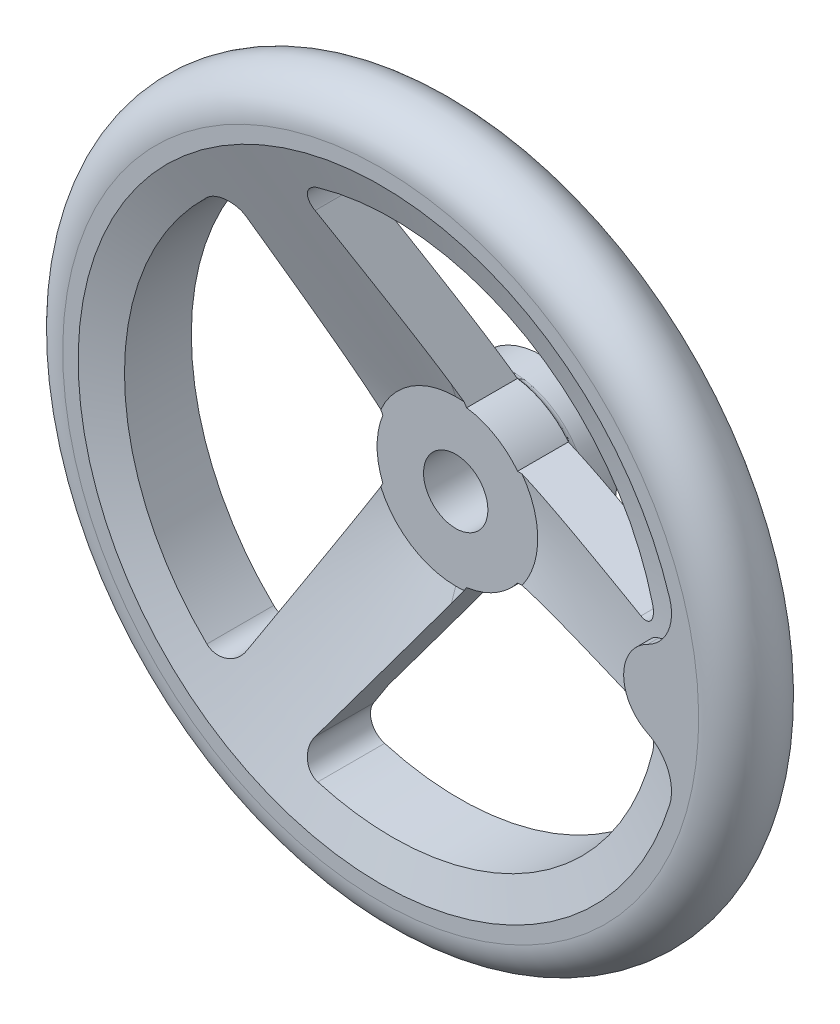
ISO-10303-21;
HEADER;
FILE_DESCRIPTION(('STEP AP214'),'2;1');
FILE_NAME('part.step','',(''),(''),'','','');
FILE_SCHEMA(('AUTOMOTIVE_DESIGN { 1 0 10303 214 1 1 1 1 }'));
ENDSEC;
DATA;
#1=APPLICATION_CONTEXT('core data for automotive mechanical design processes');
#2=APPLICATION_PROTOCOL_DEFINITION('international standard','automotive_design',2000,#1);
#3=PRODUCT_CONTEXT('',#1,'mechanical');
#4=PRODUCT('Part','Part','',(#3));
#5=PRODUCT_RELATED_PRODUCT_CATEGORY('part','',(#4));
#6=PRODUCT_DEFINITION_FORMATION('','',#4);
#7=PRODUCT_DEFINITION_CONTEXT('part definition',#1,'design');
#8=PRODUCT_DEFINITION('design','',#6,#7);
#9=PRODUCT_DEFINITION_SHAPE('','',#8);
#10=(LENGTH_UNIT() NAMED_UNIT(*) SI_UNIT(.MILLI.,.METRE.));
#11=(NAMED_UNIT(*) PLANE_ANGLE_UNIT() SI_UNIT($,.RADIAN.));
#12=(NAMED_UNIT(*) SI_UNIT($,.STERADIAN.) SOLID_ANGLE_UNIT());
#13=UNCERTAINTY_MEASURE_WITH_UNIT(LENGTH_MEASURE(1.E-05),#10,'distance_accuracy_value','');
#14=(GEOMETRIC_REPRESENTATION_CONTEXT(3) GLOBAL_UNCERTAINTY_ASSIGNED_CONTEXT((#13)) GLOBAL_UNIT_ASSIGNED_CONTEXT((#10,
#11,#12)) REPRESENTATION_CONTEXT('',''));
#15=CARTESIAN_POINT('',(0.,0.,0.));
#16=DIRECTION('',(0.,0.,1.));
#17=DIRECTION('',(1.,0.,0.));
#18=AXIS2_PLACEMENT_3D('',#15,#16,#17);
#19=CARTESIAN_POINT('',(0.,0.,9.256002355));
#20=DIRECTION('',(0.,0.,1.));
#21=DIRECTION('',(0.,-1.,0.));
#22=AXIS2_PLACEMENT_3D('',#19,#20,#21);
#23=CONICAL_SURFACE('',#22,20.355704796,1.24279917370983);
#24=CARTESIAN_POINT('',(-19.8827182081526,57.3988340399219,23.0000000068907));
#25=CARTESIAN_POINT('',(-19.0573237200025,56.1177141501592,22.4961663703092));
#26=CARTESIAN_POINT('',(-18.2317634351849,54.836336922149,21.9932550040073));
#27=CARTESIAN_POINT('',(-16.580192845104,52.2728839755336,20.9899215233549));
#28=CARTESIAN_POINT('',(-15.754182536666,50.9908082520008,20.489499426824));
#29=CARTESIAN_POINT('',(-14.1013629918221,48.4254167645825,19.4916501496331));
#30=CARTESIAN_POINT('',(-13.2745535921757,47.1421007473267,18.9942238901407));
#31=CARTESIAN_POINT('',(-11.6202147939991,44.5743511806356,18.0034882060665));
#32=CARTESIAN_POINT('',(-10.7926853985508,43.2899176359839,17.5101787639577));
#33=CARTESIAN_POINT('',(-9.13734841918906,40.7206187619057,16.5294643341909));
#34=CARTESIAN_POINT('',(-8.30954161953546,39.4357546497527,16.042054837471));
#35=CARTESIAN_POINT('',(-6.65262448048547,36.864003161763,15.0747588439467));
#36=CARTESIAN_POINT('',(-5.82351412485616,35.5771157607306,14.5948724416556));
#37=CARTESIAN_POINT('',(-4.57854573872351,33.6447624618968,13.8831413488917));
#38=CARTESIAN_POINT('',(-4.16336447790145,33.0003469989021,13.6472615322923));
#39=CARTESIAN_POINT('',(-3.33246046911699,31.7106756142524,13.178778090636));
#40=CARTESIAN_POINT('',(-2.91673772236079,31.0654196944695,12.9461744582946));
#41=CARTESIAN_POINT('',(-2.08465123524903,29.7739129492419,12.4849689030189));
#42=CARTESIAN_POINT('',(-1.6682875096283,29.1276621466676,12.2563668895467));
#43=CARTESIAN_POINT('',(-0.834775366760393,27.8339425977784,11.8040990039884));
#44=CARTESIAN_POINT('',(-0.417626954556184,27.186473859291,11.5804331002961));
#45=CARTESIAN_POINT('',(0.254294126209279,26.1435647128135,11.2255460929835));
#46=CARTESIAN_POINT('',(0.508765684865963,25.7485916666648,11.0923813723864));
#47=CARTESIAN_POINT('',(1.01811146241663,24.9580205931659,10.8286975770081));
#48=CARTESIAN_POINT('',(1.27298568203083,24.5624225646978,10.6981785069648));
#49=CARTESIAN_POINT('',(1.78321535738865,23.770479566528,10.4401807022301));
#50=CARTESIAN_POINT('',(2.03857086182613,23.374134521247,10.3127022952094));
#51=CARTESIAN_POINT('',(2.54980034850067,22.5806396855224,10.0613139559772));
#52=CARTESIAN_POINT('',(2.80567433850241,22.183489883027,9.9374040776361));
#53=CARTESIAN_POINT('',(3.06183597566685,21.7858936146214,9.81553722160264));
#54=B_SPLINE_CURVE_WITH_KNOTS('',3,(#24,#25,#26,#27,#28,#29,#30,#31,#32,#33,#34,#35,#36,#37,#38,
#39,#40,#41,#42,#43,#44,#45,#46,#47,#48,#49,#50,#51,#52,#53),.UNSPECIFIED.,.F.,.F.,(4,2,2,2,2,2,
2,2,2,2,2,2,2,2,4),(0.,4.81534496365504,9.63072434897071,14.4475156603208,19.2642864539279,
24.0771083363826,28.8899906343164,31.2961385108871,33.7022810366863,36.1083690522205,
38.5144416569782,39.979505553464,41.4445720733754,42.9097957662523,44.3750415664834),.UNSPECIFIED.);
#55=CARTESIAN_POINT('',(-19.8827182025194,57.3988340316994,23.0000000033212));
#56=VERTEX_POINT('',#55);
#57=CARTESIAN_POINT('',(2.8088604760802,22.1785445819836,9.93657949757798));
#58=VERTEX_POINT('',#57);
#59=EDGE_CURVE('E342',#56,#58,#54,.T.);
#60=ORIENTED_EDGE('',*,*,#59,.T.);
#61=CARTESIAN_POINT('',(0.,0.,9.93657949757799));
#62=DIRECTION('',(0.,0.,-1.));
#63=DIRECTION('',(-1.,0.,0.));
#64=AXIS2_PLACEMENT_3D('',#61,#62,#63);
#65=CIRCLE('',#64,22.3557047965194);
#66=CARTESIAN_POINT('',(-20.611613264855,8.65672776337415,9.93657949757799));
#67=VERTEX_POINT('',#66);
#68=EDGE_CURVE('E461',#58,#67,#65,.F.);
#69=ORIENTED_EDGE('',*,*,#68,.T.);
#70=CARTESIAN_POINT('',(-20.3980553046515,8.24131907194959,9.81553722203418));
#71=CARTESIAN_POINT('',(-20.6067638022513,8.64729468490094,9.93315364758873));
#72=CARTESIAN_POINT('',(-20.8152459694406,9.05283004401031,10.0526752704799));
#73=CARTESIAN_POINT('',(-21.2318008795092,9.86310435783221,10.2950597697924));
#74=CARTESIAN_POINT('',(-21.4398736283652,10.2678433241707,10.4179225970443));
#75=CARTESIAN_POINT('',(-21.8556467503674,11.0765969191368,10.6665164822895));
#76=CARTESIAN_POINT('',(-22.0633471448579,11.4806115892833,10.7922473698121));
#77=CARTESIAN_POINT('',(-22.478428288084,12.2880191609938,11.0462129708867));
#78=CARTESIAN_POINT('',(-22.6858090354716,12.6914120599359,11.174447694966));
#79=CARTESIAN_POINT('',(-23.3074607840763,13.9006366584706,11.5623706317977));
#80=CARTESIAN_POINT('',(-23.7213069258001,14.7056419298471,11.8253170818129));
#81=CARTESIAN_POINT('',(-24.5481054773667,16.3139140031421,12.3578832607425));
#82=CARTESIAN_POINT('',(-24.9610578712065,17.1171807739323,12.6275031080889));
#83=CARTESIAN_POINT('',(-25.786152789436,18.7221389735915,13.1719058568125));
#84=CARTESIAN_POINT('',(-26.1982954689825,19.5238307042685,13.4466876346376));
#85=CARTESIAN_POINT('',(-27.0219954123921,21.1260754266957,14.0003918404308));
#86=CARTESIAN_POINT('',(-27.4335526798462,21.9266284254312,14.2793142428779));
#87=CARTESIAN_POINT('',(-28.2562102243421,23.5268454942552,14.840505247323));
#88=CARTESIAN_POINT('',(-28.6673104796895,24.3265095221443,15.1227740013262));
#89=CARTESIAN_POINT('',(-29.489118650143,25.9250744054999,15.6900331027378));
#90=CARTESIAN_POINT('',(-29.8998265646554,26.7239752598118,15.9750234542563));
#91=CARTESIAN_POINT('',(-31.1000612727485,29.0586479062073,16.8114533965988));
#92=CARTESIAN_POINT('',(-31.8891497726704,30.5935671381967,17.3659012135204));
#93=CARTESIAN_POINT('',(-33.4664494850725,33.6616991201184,18.4806125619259));
#94=CARTESIAN_POINT('',(-34.2546607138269,35.1949119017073,19.0408759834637));
#95=CARTESIAN_POINT('',(-35.8305769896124,38.2603528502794,20.1657859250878));
#96=CARTESIAN_POINT('',(-36.6182819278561,39.7925808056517,20.7304331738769));
#97=CARTESIAN_POINT('',(-37.7994801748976,42.090224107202,21.5798358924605));
#98=CARTESIAN_POINT('',(-38.1931561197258,42.8559947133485,21.8633776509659));
#99=CARTESIAN_POINT('',(-38.9804000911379,44.3873260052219,22.4311761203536));
#100=CARTESIAN_POINT('',(-39.3739681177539,45.1528866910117,22.715432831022));
#101=CARTESIAN_POINT('',(-39.7674892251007,45.9183561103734,22.9999999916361));
#102=B_SPLINE_CURVE_WITH_KNOTS('',3,(#70,#71,#72,#73,#74,#75,#76,#77,#78,#79,#80,#81,#82,#83,
#84,#85,#86,#87,#88,#89,#90,#91,#92,#93,#94,#95,#96,#97,#98,#99,#100,#101),.UNSPECIFIED.,.F.,
.F.,(4,2,2,2,2,2,2,2,2,2,2,2,2,2,2,4),(0.,1.41416174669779,2.82830269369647,4.24235980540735,
5.65642286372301,8.4841023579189,11.3118320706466,14.1389532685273,16.9660570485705,
19.7932897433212,22.6205267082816,28.0587494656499,33.4968695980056,38.9359139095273,
41.6554783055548,44.3750418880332),.UNSPECIFIED.);
#103=CARTESIAN_POINT('',(-39.7674892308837,45.9183561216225,22.9999999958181));
#104=VERTEX_POINT('',#103);
#105=EDGE_CURVE('E466',#67,#104,#102,.T.);
#106=ORIENTED_EDGE('',*,*,#105,.T.);
#107=CARTESIAN_POINT('',(0.,0.,23.));
#108=DIRECTION('',(0.,0.,1.));
#109=DIRECTION('',(0.,-1.,0.));
#110=AXIS2_PLACEMENT_3D('',#107,#108,#109);
#111=CIRCLE('',#110,60.744947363);
#112=EDGE_CURVE('E253',#104,#56,#111,.F.);
#113=ORIENTED_EDGE('',*,*,#112,.T.);
#114=EDGE_LOOP('',(#60,#69,#106,#113));
#115=FACE_BOUND('',#114,.T.);
#116=ADVANCED_FACE('F14',(#115),#23,.T.);
#117=CARTESIAN_POINT('',(-39.7674892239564,-45.9183561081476,22.9999999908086));
#118=CARTESIAN_POINT('',(-39.3661933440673,-45.1377633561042,22.7098105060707));
#119=CARTESIAN_POINT('',(-38.9648486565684,-44.3570756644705,22.4199440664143));
#120=CARTESIAN_POINT('',(-38.1620466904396,-42.7954812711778,21.8409565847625));
#121=CARTESIAN_POINT('',(-37.7605894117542,-42.0145745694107,21.5518355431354));
#122=CARTESIAN_POINT('',(-36.5560254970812,-39.6714808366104,20.6857389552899));
#123=CARTESIAN_POINT('',(-35.7527281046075,-38.10892274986,20.1100309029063));
#124=CARTESIAN_POINT('',(-34.5473505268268,-35.7642462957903,19.2499115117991));
#125=CARTESIAN_POINT('',(-34.1455231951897,-34.9826197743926,18.9638050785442));
#126=CARTESIAN_POINT('',(-33.3416712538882,-33.4189829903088,18.3929233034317));
#127=CARTESIAN_POINT('',(-32.9396466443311,-32.6369727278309,18.1081479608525));
#128=CARTESIAN_POINT('',(-31.7332146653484,-30.2902452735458,17.2561290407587));
#129=CARTESIAN_POINT('',(-30.9284640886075,-28.7248604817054,16.6912032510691));
#130=CARTESIAN_POINT('',(-29.7202793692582,-26.3747236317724,15.8503596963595));
#131=CARTESIAN_POINT('',(-29.317326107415,-25.5909069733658,15.5711361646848));
#132=CARTESIAN_POINT('',(-28.5110322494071,-24.0225202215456,15.0153795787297));
#133=CARTESIAN_POINT('',(-28.1076916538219,-23.2379501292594,14.7388465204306));
#134=CARTESIAN_POINT('',(-27.3005602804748,-21.6679342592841,14.189079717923));
#135=CARTESIAN_POINT('',(-26.8967695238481,-20.8824885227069,13.9158458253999));
#136=CARTESIAN_POINT('',(-26.0886133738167,-19.3104792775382,13.3734496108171));
#137=CARTESIAN_POINT('',(-25.684247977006,-18.5239157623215,13.1042873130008));
#138=CARTESIAN_POINT('',(-24.8747251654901,-16.9492481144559,12.5710215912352));
#139=CARTESIAN_POINT('',(-24.4695675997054,-16.1611436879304,12.306919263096));
#140=CARTESIAN_POINT('',(-23.6583807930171,-14.5832392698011,11.7852322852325));
#141=CARTESIAN_POINT('',(-23.252351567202,-13.7934393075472,11.5276475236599));
#142=CARTESIAN_POINT('',(-22.6424509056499,-12.6070726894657,11.1475884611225));
#143=CARTESIAN_POINT('',(-22.4389920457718,-12.2113085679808,11.021945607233));
#144=CARTESIAN_POINT('',(-22.0317646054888,-11.4191778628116,10.7730887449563));
#145=CARTESIAN_POINT('',(-21.827996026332,-11.0228112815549,10.6498747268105));
#146=CARTESIAN_POINT('',(-21.4200991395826,-10.2293783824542,10.4062221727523));
#147=CARTESIAN_POINT('',(-21.2159708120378,-9.83231202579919,10.285783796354));
#148=CARTESIAN_POINT('',(-20.807319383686,-9.03741140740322,10.0481311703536));
#149=CARTESIAN_POINT('',(-20.6027962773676,-8.63957713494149,9.93091696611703));
#150=CARTESIAN_POINT('',(-20.3980553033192,-8.24131907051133,9.81553722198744));
#151=B_SPLINE_CURVE_WITH_KNOTS('',3,(#117,#118,#119,#120,#121,#122,#123,#124,#125,#126,#127,
#128,#129,#130,#131,#132,#133,#134,#135,#136,#137,#138,#139,#140,#141,#142,#143,#144,#145,#146,
#147,#148,#149,#150),.UNSPECIFIED.,.F.,.F.,(4,2,2,2,2,2,2,2,2,2,2,2,2,2,2,2,4),(0.,
2.77329390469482,5.54658917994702,11.0931888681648,13.8659768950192,16.6387634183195,
22.1844396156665,24.9579452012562,27.7314466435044,30.504822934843,33.2782157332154,
36.052202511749,38.8261416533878,40.2133267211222,41.6005062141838,42.9877652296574,
44.375043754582),.UNSPECIFIED.);
#152=CARTESIAN_POINT('',(-39.7674892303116,-45.9183561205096,22.9999999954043));
#153=VERTEX_POINT('',#152);
#154=CARTESIAN_POINT('',(-20.611613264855,-8.65672776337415,9.93657949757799));
#155=VERTEX_POINT('',#154);
#156=EDGE_CURVE('E465',#153,#155,#151,.T.);
#157=ORIENTED_EDGE('',*,*,#156,.T.);
#158=CARTESIAN_POINT('',(0.,0.,9.93657949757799));
#159=DIRECTION('',(0.,0.,-1.));
#160=DIRECTION('',(-1.,0.,0.));
#161=AXIS2_PLACEMENT_3D('',#158,#159,#160);
#162=CIRCLE('',#161,22.3557047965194);
#163=CARTESIAN_POINT('',(2.80886047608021,-22.1785445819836,9.93657949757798));
#164=VERTEX_POINT('',#163);
#165=EDGE_CURVE('E774',#155,#164,#162,.F.);
#166=ORIENTED_EDGE('',*,*,#165,.T.);
#167=CARTESIAN_POINT('',(3.06183597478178,-21.785893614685,9.81553722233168));
#168=CARTESIAN_POINT('',(2.80567195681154,-22.1834935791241,9.93740502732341));
#169=CARTESIAN_POINT('',(2.5497956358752,-22.5806469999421,10.0613161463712));
#170=CARTESIAN_POINT('',(2.03856183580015,-23.3741485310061,10.3127068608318));
#171=CARTESIAN_POINT('',(1.78320434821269,-23.7704966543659,10.4401863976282));
#172=CARTESIAN_POINT('',(1.27297537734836,-24.5624385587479,10.6981835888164));
#173=CARTESIAN_POINT('',(1.0181038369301,-24.9580324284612,10.8287008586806));
#174=CARTESIAN_POINT('',(0.508762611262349,-25.7485964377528,11.0923836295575));
#175=CARTESIAN_POINT('',(0.254292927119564,-26.1435665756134,11.2255491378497));
#176=CARTESIAN_POINT('',(-0.59166348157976,-27.4566012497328,11.6723479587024));
#177=CARTESIAN_POINT('',(-1.18237012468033,-28.3734549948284,11.9910188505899));
#178=CARTESIAN_POINT('',(-2.36233780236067,-30.2049187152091,12.6373718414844));
#179=CARTESIAN_POINT('',(-2.95159881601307,-31.1195286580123,12.9650540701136));
#180=CARTESIAN_POINT('',(-4.12903106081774,-32.9470570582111,13.6271924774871));
#181=CARTESIAN_POINT('',(-4.71720224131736,-33.8599754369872,13.9616489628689));
#182=CARTESIAN_POINT('',(-5.89267091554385,-35.6844561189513,14.6357266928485));
#183=CARTESIAN_POINT('',(-6.47996841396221,-36.5960184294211,14.9753479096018));
#184=CARTESIAN_POINT('',(-7.65401892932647,-38.4182979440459,15.6587012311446));
#185=CARTESIAN_POINT('',(-8.24077177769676,-39.3290148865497,16.002434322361));
#186=CARTESIAN_POINT('',(-9.41372621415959,-41.1495931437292,16.6930939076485));
#187=CARTESIAN_POINT('',(-9.99992780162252,-42.0594544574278,17.040020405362));
#188=CARTESIAN_POINT('',(-11.1718684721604,-43.8784592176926,17.7364330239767));
#189=CARTESIAN_POINT('',(-11.7576075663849,-44.7876026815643,18.0859190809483));
#190=CARTESIAN_POINT('',(-12.9287177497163,-46.6053184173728,18.7869873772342));
#191=CARTESIAN_POINT('',(-13.5140888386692,-47.5138906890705,19.1385696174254));
#192=CARTESIAN_POINT('',(-15.0640206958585,-49.9195870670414,20.072003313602));
#193=CARTESIAN_POINT('',(-16.0283202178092,-51.4163056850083,20.6553335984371));
#194=CARTESIAN_POINT('',(-17.4741881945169,-53.6604813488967,21.5328702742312));
#195=CARTESIAN_POINT('',(-17.9559894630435,-54.4082997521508,21.8257707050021));
#196=CARTESIAN_POINT('',(-18.9194530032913,-55.9037208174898,22.4123369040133));
#197=CARTESIAN_POINT('',(-19.4011152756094,-56.6513234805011,22.7060026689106));
#198=CARTESIAN_POINT('',(-19.8827182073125,-57.398834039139,23.0000000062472));
#199=B_SPLINE_CURVE_WITH_KNOTS('',3,(#167,#168,#169,#170,#171,#172,#173,#174,#175,#176,#177,
#178,#179,#180,#181,#182,#183,#184,#185,#186,#187,#188,#189,#190,#191,#192,#193,#194,#195,#196,
#197,#198),.UNSPECIFIED.,.F.,.F.,(4,2,2,2,2,2,2,2,2,2,2,2,2,2,2,4),(0.,1.46525924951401,
2.9304944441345,4.39554516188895,5.8605999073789,9.26934333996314,12.6781358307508,
16.0870829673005,19.4960117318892,22.9057753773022,26.315542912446,29.725225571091,
33.1349096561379,38.755653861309,41.565351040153,44.3750359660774),.UNSPECIFIED.);
#200=CARTESIAN_POINT('',(-19.8827182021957,-57.3988340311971,23.0000000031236));
#201=VERTEX_POINT('',#200);
#202=EDGE_CURVE('E469',#164,#201,#199,.T.);
#203=ORIENTED_EDGE('',*,*,#202,.T.);
#204=CARTESIAN_POINT('',(0.,0.,23.));
#205=DIRECTION('',(0.,0.,1.));
#206=DIRECTION('',(0.,-1.,0.));
#207=AXIS2_PLACEMENT_3D('',#204,#205,#206);
#208=CIRCLE('',#207,60.744947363);
#209=EDGE_CURVE('E264',#201,#153,#208,.F.);
#210=ORIENTED_EDGE('',*,*,#209,.T.);
#211=EDGE_LOOP('',(#157,#166,#203,#210));
#212=FACE_BOUND('',#211,.T.);
#213=ADVANCED_FACE('F639',(#212),#23,.T.);
#214=CARTESIAN_POINT('',(-19.29416296,19.228,0.));
#215=DIRECTION('',(0.,0.,1.));
#216=DIRECTION('',(0.,-1.,0.));
#217=AXIS2_PLACEMENT_3D('',#214,#215,#216);
#218=PLANE('',#217);
#219=CARTESIAN_POINT('',(0.,0.,0.));
#220=DIRECTION('',(0.,0.,1.));
#221=DIRECTION('',(0.,-1.,0.));
#222=AXIS2_PLACEMENT_3D('',#219,#220,#221);
#223=CIRCLE('',#222,9.);
#224=CARTESIAN_POINT('',(0.,-9.,0.));
#225=VERTEX_POINT('',#224);
#226=EDGE_CURVE('E621',#225,#225,#223,.T.);
#227=ORIENTED_EDGE('',*,*,#226,.T.);
#228=EDGE_LOOP('',(#227));
#229=FACE_BOUND('',#228,.T.);
#230=CARTESIAN_POINT('',(0.,0.,0.));
#231=DIRECTION('',(0.,0.,-1.));
#232=DIRECTION('',(-1.,0.,0.));
#233=AXIS2_PLACEMENT_3D('',#230,#231,#232);
#234=CIRCLE('',#233,21.);
#235=CARTESIAN_POINT('',(-21.,0.,0.));
#236=VERTEX_POINT('',#235);
#237=EDGE_CURVE('E624',#236,#236,#234,.T.);
#238=ORIENTED_EDGE('',*,*,#237,.T.);
#239=EDGE_LOOP('',(#238));
#240=FACE_BOUND('',#239,.T.);
#241=ADVANCED_FACE('F640',(#229,#240),#218,.F.);
#242=CARTESIAN_POINT('',(69.405690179,21.535101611,41.852277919));
#243=DIRECTION('',(0.,0.,1.));
#244=DIRECTION('',(0.,-1.,0.));
#245=AXIS2_PLACEMENT_3D('',#242,#243,#244);
#246=CYLINDRICAL_SURFACE('',#245,12.);
#247=CARTESIAN_POINT('',(80.8741519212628,25.0670111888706,44.999999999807));
#248=CARTESIAN_POINT('',(80.9705563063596,24.7541218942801,44.9998073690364));
#249=CARTESIAN_POINT('',(81.0540714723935,24.4372758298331,44.9956835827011));
#250=CARTESIAN_POINT('',(81.194917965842,23.7980489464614,44.9796416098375));
#251=CARTESIAN_POINT('',(81.2522524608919,23.4756688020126,44.9677243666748));
#252=CARTESIAN_POINT('',(81.3402804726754,22.8282292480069,44.936190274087));
#253=CARTESIAN_POINT('',(81.3710193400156,22.503175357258,44.9165866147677));
#254=CARTESIAN_POINT('',(81.4059271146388,21.8521899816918,44.86980798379));
#255=CARTESIAN_POINT('',(81.4100959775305,21.5262584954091,44.842632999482));
#256=CARTESIAN_POINT('',(81.3919823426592,20.8758045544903,44.7808802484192));
#257=CARTESIAN_POINT('',(81.3696970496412,20.5512822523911,44.7463016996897));
#258=CARTESIAN_POINT('',(81.2990168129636,19.9059460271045,44.6699590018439));
#259=CARTESIAN_POINT('',(81.2506213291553,19.5851321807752,44.6281947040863));
#260=CARTESIAN_POINT('',(81.1282768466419,18.9494229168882,44.537737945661));
#261=CARTESIAN_POINT('',(81.0543285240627,18.6345273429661,44.4890456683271));
#262=CARTESIAN_POINT('',(80.8816259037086,18.0127424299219,44.3850238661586));
#263=CARTESIAN_POINT('',(80.7828714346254,17.7058531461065,44.329694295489));
#264=CARTESIAN_POINT('',(80.5597344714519,17.0973130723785,44.2118010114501));
#265=CARTESIAN_POINT('',(80.4349734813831,16.7958204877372,44.1491372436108));
#266=CARTESIAN_POINT('',(80.1619322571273,16.2050786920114,44.0176635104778));
#267=CARTESIAN_POINT('',(80.0136516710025,15.9158296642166,43.9488534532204));
#268=CARTESIAN_POINT('',(79.6947550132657,15.3512260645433,43.8054447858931));
#269=CARTESIAN_POINT('',(79.524127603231,15.0758786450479,43.7308432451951));
#270=CARTESIAN_POINT('',(79.161982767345,14.5408823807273,43.5763001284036));
#271=CARTESIAN_POINT('',(78.9704654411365,14.2812334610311,43.496358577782));
#272=CARTESIAN_POINT('',(78.5602323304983,13.7694055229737,43.3283821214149));
#273=CARTESIAN_POINT('',(78.3407514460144,13.5179030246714,43.2401538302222));
#274=CARTESIAN_POINT('',(77.8825782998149,13.0349148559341,43.0589070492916));
#275=CARTESIAN_POINT('',(77.6438852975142,12.803429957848,42.9658883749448));
#276=CARTESIAN_POINT('',(77.1493594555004,12.362024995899,42.7756846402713));
#277=CARTESIAN_POINT('',(76.893544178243,12.1520833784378,42.6785038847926));
#278=CARTESIAN_POINT('',(76.3664935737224,11.7547094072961,42.4804565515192));
#279=CARTESIAN_POINT('',(76.095264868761,11.5672674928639,42.3795915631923));
#280=CARTESIAN_POINT('',(75.6367468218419,11.2774428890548,42.210641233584));
#281=CARTESIAN_POINT('',(75.4533703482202,11.1682799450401,42.1434625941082));
#282=CARTESIAN_POINT('',(75.0817245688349,10.9602300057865,42.00804429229));
#283=CARTESIAN_POINT('',(74.8934644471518,10.8613252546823,41.9398067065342));
#284=CARTESIAN_POINT('',(74.702845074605,10.7675508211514,41.8710516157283));
#285=B_SPLINE_CURVE_WITH_KNOTS('',3,(#247,#248,#249,#250,#251,#252,#253,#254,#255,#256,#257,
#258,#259,#260,#261,#262,#263,#264,#265,#266,#267,#268,#269,#270,#271,#272,#273,#274,#275,#276,
#277,#278,#279,#280,#281,#282,#283,#284),.UNSPECIFIED.,.F.,.F.,(4,2,2,2,2,2,2,2,2,2,2,2,2,2,2,2,
2,2,4),(0.,0.981899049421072,1.96367926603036,2.94378204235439,3.92388645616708,
4.90409444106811,5.88432270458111,6.86452503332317,7.84473413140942,8.84035331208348,
9.83598739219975,10.8321286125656,11.828265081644,12.8629000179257,13.8975748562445,
14.9312042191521,15.9643927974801,16.6353213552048,17.3050685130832),.UNSPECIFIED.);
#286=CARTESIAN_POINT('',(80.8741518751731,25.0670113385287,44.9999999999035));
#287=VERTEX_POINT('',#286);
#288=CARTESIAN_POINT('',(74.7028450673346,10.7675508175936,41.8710516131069));
#289=VERTEX_POINT('',#288);
#290=EDGE_CURVE('E981',#287,#289,#285,.T.);
#291=ORIENTED_EDGE('',*,*,#290,.T.);
#292=DIRECTION('',(0.,0.,-1.));
#293=VECTOR('',#292,1.);
#294=CARTESIAN_POINT('',(74.702845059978,10.7675508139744,42.1337841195));
#295=LINE('',#294,#293);
#296=CARTESIAN_POINT('',(74.7028450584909,10.7675508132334,45.));
#297=VERTEX_POINT('',#296);
#298=EDGE_CURVE('E622',#297,#289,#295,.T.);
#299=ORIENTED_EDGE('',*,*,#298,.F.);
#300=CARTESIAN_POINT('',(69.405690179,21.535101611,45.));
#301=DIRECTION('',(0.,0.,1.));
#302=DIRECTION('',(0.,-1.,0.));
#303=AXIS2_PLACEMENT_3D('',#300,#301,#302);
#304=CIRCLE('',#303,12.);
#305=EDGE_CURVE('E988',#297,#287,#304,.T.);
#306=ORIENTED_EDGE('',*,*,#305,.T.);
#307=EDGE_LOOP('',(#291,#299,#306));
#308=FACE_BOUND('',#307,.T.);
#309=ADVANCED_FACE('F643',(#308),#246,.F.);
#310=CARTESIAN_POINT('',(79.999999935,1.39999999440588E-08,39.2930554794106));
#311=DIRECTION('',(0.,0.,1.));
#312=DIRECTION('',(0.,-1.,0.));
#313=AXIS2_PLACEMENT_3D('',#310,#311,#312);
#314=CYLINDRICAL_SURFACE('',#313,12.);
#315=DIRECTION('',(0.,0.,1.));
#316=VECTOR('',#315,1.);
#317=CARTESIAN_POINT('',(74.7028450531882,-10.7675507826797,43.426138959));
#318=LINE('',#317,#316);
#319=CARTESIAN_POINT('',(74.7028450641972,-10.7675507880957,41.8710516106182));
#320=VERTEX_POINT('',#319);
#321=CARTESIAN_POINT('',(74.7028450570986,-10.7675507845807,45.));
#322=VERTEX_POINT('',#321);
#323=EDGE_CURVE('E619',#320,#322,#318,.T.);
#324=ORIENTED_EDGE('',*,*,#323,.T.);
#325=CARTESIAN_POINT('',(79.999999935,1.39999999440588E-08,45.));
#326=DIRECTION('',(0.,0.,1.));
#327=DIRECTION('',(0.,-1.,0.));
#328=AXIS2_PLACEMENT_3D('',#325,#326,#327);
#329=CIRCLE('',#328,12.);
#330=EDGE_CURVE('E991',#322,#297,#329,.F.);
#331=ORIENTED_EDGE('',*,*,#330,.T.);
#332=ORIENTED_EDGE('',*,*,#298,.T.);
#333=CARTESIAN_POINT('',(74.7028450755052,10.7675508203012,41.8710516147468));
#334=CARTESIAN_POINT('',(74.398503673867,10.6178550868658,41.7612856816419));
#335=CARTESIAN_POINT('',(74.1000946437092,10.4550000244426,41.6529415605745));
#336=CARTESIAN_POINT('',(73.5171349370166,10.1038667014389,41.4399782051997));
#337=CARTESIAN_POINT('',(73.2325874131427,9.91558269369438,41.3353598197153));
#338=CARTESIAN_POINT('',(72.6788552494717,9.51409969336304,41.1305471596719));
#339=CARTESIAN_POINT('',(72.4097070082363,9.30084502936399,41.0303634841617));
#340=CARTESIAN_POINT('',(71.8895621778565,8.8509333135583,40.8356397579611));
#341=CARTESIAN_POINT('',(71.6385641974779,8.61427805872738,40.7410992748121));
#342=CARTESIAN_POINT('',(71.1562710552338,8.11839393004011,40.5584564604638));
#343=CARTESIAN_POINT('',(70.9250157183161,7.85912146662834,40.4703671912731));
#344=CARTESIAN_POINT('',(70.4848036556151,7.31998226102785,40.3018431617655));
#345=CARTESIAN_POINT('',(70.2758456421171,7.04011670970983,40.22140795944));
#346=CARTESIAN_POINT('',(69.882393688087,6.46190312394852,40.0692709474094));
#347=CARTESIAN_POINT('',(69.6978734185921,6.16357549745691,39.9975597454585));
#348=CARTESIAN_POINT('',(69.354898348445,5.55024691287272,39.8637418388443));
#349=CARTESIAN_POINT('',(69.1964419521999,5.23524697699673,39.8016345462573));
#350=CARTESIAN_POINT('',(68.9143059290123,4.60654858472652,39.6906855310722));
#351=CARTESIAN_POINT('',(68.7893130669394,4.29352689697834,39.6413467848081));
#352=CARTESIAN_POINT('',(68.5657601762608,3.65677489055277,39.552880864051));
#353=CARTESIAN_POINT('',(68.467199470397,3.33304484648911,39.5137534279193));
#354=CARTESIAN_POINT('',(68.2975917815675,2.6773695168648,39.446297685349));
#355=CARTESIAN_POINT('',(68.2265432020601,2.3454247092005,39.4179687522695));
#356=CARTESIAN_POINT('',(68.1127624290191,1.67596166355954,39.3725510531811));
#357=CARTESIAN_POINT('',(68.0700289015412,1.33844368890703,39.3554617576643));
#358=CARTESIAN_POINT('',(68.0150882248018,0.681161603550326,39.3334825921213));
#359=CARTESIAN_POINT('',(68.0011890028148,0.361560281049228,39.3279165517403));
#360=CARTESIAN_POINT('',(67.9989572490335,-0.277737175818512,39.3270231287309));
#361=CARTESIAN_POINT('',(68.0106235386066,-0.597433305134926,39.3316952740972));
#362=CARTESIAN_POINT('',(68.0593950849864,-1.23450486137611,39.3512085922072));
#363=CARTESIAN_POINT('',(68.0964958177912,-1.55188069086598,39.3660479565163));
#364=CARTESIAN_POINT('',(68.1957479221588,-2.1820581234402,39.4056823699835));
#365=CARTESIAN_POINT('',(68.2578993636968,-2.49485971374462,39.4304774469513));
#366=CARTESIAN_POINT('',(68.4053404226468,-3.10832316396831,39.4891674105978));
#367=CARTESIAN_POINT('',(68.4902124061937,-3.40910135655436,39.5228979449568));
#368=CARTESIAN_POINT('',(68.6827427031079,-4.00210819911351,39.5992049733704));
#369=CARTESIAN_POINT('',(68.7904006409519,-4.29433698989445,39.6417813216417));
#370=CARTESIAN_POINT('',(69.0275387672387,-4.86842422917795,39.7352583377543));
#371=CARTESIAN_POINT('',(69.1570195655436,-5.15028238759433,39.7861592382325));
#372=CARTESIAN_POINT('',(69.4366969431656,-5.70195388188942,39.8956943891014));
#373=CARTESIAN_POINT('',(69.5868939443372,-5.97176697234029,39.9543287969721));
#374=CARTESIAN_POINT('',(69.912468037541,-6.50717386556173,40.0808997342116));
#375=CARTESIAN_POINT('',(70.0885489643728,-6.77227909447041,40.1490923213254));
#376=CARTESIAN_POINT('',(70.4602664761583,-7.28657660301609,40.2923742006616));
#377=CARTESIAN_POINT('',(70.6559106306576,-7.53576266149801,40.3674661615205));
#378=CARTESIAN_POINT('',(71.0652045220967,-8.01680537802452,40.5237695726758));
#379=CARTESIAN_POINT('',(71.2788541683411,-8.24866212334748,40.6049809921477));
#380=CARTESIAN_POINT('',(71.7227071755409,-8.69397895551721,40.7727990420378));
#381=CARTESIAN_POINT('',(71.9529150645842,-8.90743397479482,40.8594071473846));
#382=CARTESIAN_POINT('',(72.3828351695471,-9.27593339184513,41.0202542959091));
#383=CARTESIAN_POINT('',(72.5799725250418,-9.43434663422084,41.0936958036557));
#384=CARTESIAN_POINT('',(72.9832013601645,-9.73797858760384,41.243227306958));
#385=CARTESIAN_POINT('',(73.1892926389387,-9.88319759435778,41.3193172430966));
#386=CARTESIAN_POINT('',(73.6091360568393,-10.1597193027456,41.473601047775));
#387=CARTESIAN_POINT('',(73.8228703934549,-10.2910518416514,41.5517899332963));
#388=CARTESIAN_POINT('',(74.2576110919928,-10.5398166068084,41.7100778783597));
#389=CARTESIAN_POINT('',(74.4786177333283,-10.6572482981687,41.7901770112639));
#390=CARTESIAN_POINT('',(74.7028450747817,-10.7675507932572,41.8710516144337));
#391=B_SPLINE_CURVE_WITH_KNOTS('',3,(#333,#334,#335,#336,#337,#338,#339,#340,#341,#342,#343,
#344,#345,#346,#347,#348,#349,#350,#351,#352,#353,#354,#355,#356,#357,#358,#359,#360,#361,#362,
#363,#364,#365,#366,#367,#368,#369,#370,#371,#372,#373,#374,#375,#376,#377,#378,#379,#380,#381,
#382,#383,#384,#385,#386,#387,#388,#389,#390),.UNSPECIFIED.,.F.,.F.,(4,2,2,2,2,2,2,2,2,2,2,2,2,
2,2,2,2,2,2,2,2,2,2,2,2,2,2,2,4),(0.,1.06919597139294,2.13863399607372,3.21050340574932,
4.28229056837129,5.35619103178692,6.43002944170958,7.50270133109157,8.57530752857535,
9.59593150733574,10.6165293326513,11.6370679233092,12.6575584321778,13.616243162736,
14.5748836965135,15.5333537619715,16.4918265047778,17.4337653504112,18.3756886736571,
19.3176383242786,20.2596071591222,21.2349657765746,22.2107032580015,23.1864358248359,
24.1624362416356,24.9519981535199,25.7415423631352,26.5293540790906,27.3171960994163),.UNSPECIFIED.);
#392=EDGE_CURVE('E742',#289,#320,#391,.T.);
#393=ORIENTED_EDGE('',*,*,#392,.T.);
#394=EDGE_LOOP('',(#324,#331,#332,#393));
#395=FACE_BOUND('',#394,.T.);
#396=ADVANCED_FACE('F754',(#395),#314,.T.);
#397=CARTESIAN_POINT('',(69.405690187,-21.535101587,41.852277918));
#398=DIRECTION('',(0.,0.,1.));
#399=DIRECTION('',(0.,-1.,0.));
#400=AXIS2_PLACEMENT_3D('',#397,#398,#399);
#401=CYLINDRICAL_SURFACE('',#400,12.);
#402=CARTESIAN_POINT('',(74.7028450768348,-10.7675507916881,41.8710516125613));
#403=CARTESIAN_POINT('',(75.0108325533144,-10.9190337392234,41.9821417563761));
#404=CARTESIAN_POINT('',(75.3126997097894,-11.0839822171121,42.0918932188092));
#405=CARTESIAN_POINT('',(75.9020679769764,-11.4397861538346,42.3080958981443));
#406=CARTESIAN_POINT('',(76.1895669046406,-11.630645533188,42.4145466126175));
#407=CARTESIAN_POINT('',(76.7484216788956,-12.0375231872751,42.6236566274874));
#408=CARTESIAN_POINT('',(77.0197511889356,-12.253580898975,42.7263096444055));
#409=CARTESIAN_POINT('',(77.5436143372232,-12.709304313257,42.9270193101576));
#410=CARTESIAN_POINT('',(77.796149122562,-12.9489685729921,43.0250762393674));
#411=CARTESIAN_POINT('',(78.2807084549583,-13.4508027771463,43.2161369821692));
#412=CARTESIAN_POINT('',(78.512702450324,-13.7130051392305,43.3091331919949));
#413=CARTESIAN_POINT('',(78.9537377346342,-14.2579019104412,43.4893284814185));
#414=CARTESIAN_POINT('',(79.1627798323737,-14.5405955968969,43.5765277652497));
#415=CARTESIAN_POINT('',(79.5558052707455,-15.1242653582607,43.7444836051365));
#416=CARTESIAN_POINT('',(79.7398139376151,-15.4252225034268,43.8252466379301));
#417=CARTESIAN_POINT('',(80.0812445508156,-16.0435400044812,43.9798914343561));
#418=CARTESIAN_POINT('',(80.2386675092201,-16.3608997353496,44.053773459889));
#419=CARTESIAN_POINT('',(80.5205549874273,-16.9988778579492,44.1918177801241));
#420=CARTESIAN_POINT('',(80.6459417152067,-17.3190366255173,44.2562216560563));
#421=CARTESIAN_POINT('',(80.8691021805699,-17.9701857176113,44.3777072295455));
#422=CARTESIAN_POINT('',(80.9668767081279,-18.3011757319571,44.4347891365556));
#423=CARTESIAN_POINT('',(81.1337751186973,-18.9716284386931,44.5412636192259));
#424=CARTESIAN_POINT('',(81.2028903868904,-19.3110936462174,44.5906538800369));
#425=CARTESIAN_POINT('',(81.3115980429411,-19.9957774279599,44.6813823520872));
#426=CARTESIAN_POINT('',(81.3511905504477,-20.3409959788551,44.7227205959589));
#427=CARTESIAN_POINT('',(81.4016848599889,-21.0543318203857,44.799181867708));
#428=CARTESIAN_POINT('',(81.4108154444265,-21.4226291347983,44.8338139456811));
#429=CARTESIAN_POINT('',(81.3951092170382,-22.1592814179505,44.8934721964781));
#430=CARTESIAN_POINT('',(81.3702704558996,-22.5276363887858,44.9184978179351));
#431=CARTESIAN_POINT('',(81.2865346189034,-23.262074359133,44.9587917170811));
#432=CARTESIAN_POINT('',(81.2275458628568,-23.6281485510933,44.9740334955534));
#433=CARTESIAN_POINT('',(81.1138342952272,-24.1720959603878,44.989401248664));
#434=CARTESIAN_POINT('',(81.0717142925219,-24.3525881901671,44.993274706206));
#435=CARTESIAN_POINT('',(80.9791521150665,-24.7114692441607,44.9985169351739));
#436=CARTESIAN_POINT('',(80.9287096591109,-24.8898579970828,44.9998856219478));
#437=CARTESIAN_POINT('',(80.8741519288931,-25.0670111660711,44.9999999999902));
#438=B_SPLINE_CURVE_WITH_KNOTS('',3,(#402,#403,#404,#405,#406,#407,#408,#409,#410,#411,#412,
#413,#414,#415,#416,#417,#418,#419,#420,#421,#422,#423,#424,#425,#426,#427,#428,#429,#430,#431,
#432,#433,#434,#435,#436,#437),.UNSPECIFIED.,.F.,.F.,(4,2,2,2,2,2,2,2,2,2,2,2,2,2,2,2,2,4),(0.,
1.0819890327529,2.16414196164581,3.24801184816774,4.33181552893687,5.41720505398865,
6.50255631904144,7.58680123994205,8.67100487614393,9.71914038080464,10.7672458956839,
11.8156662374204,12.864082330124,13.9724857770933,15.0809528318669,16.1924096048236,
16.7483697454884,17.3043486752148),.UNSPECIFIED.);
#439=CARTESIAN_POINT('',(80.8741519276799,-25.0670111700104,45.));
#440=VERTEX_POINT('',#439);
#441=EDGE_CURVE('E734',#320,#440,#438,.T.);
#442=ORIENTED_EDGE('',*,*,#441,.T.);
#443=CARTESIAN_POINT('',(69.405690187,-21.535101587,45.));
#444=DIRECTION('',(0.,0.,1.));
#445=DIRECTION('',(0.,-1.,0.));
#446=AXIS2_PLACEMENT_3D('',#443,#444,#445);
#447=CIRCLE('',#446,12.);
#448=EDGE_CURVE('E994',#440,#322,#447,.T.);
#449=ORIENTED_EDGE('',*,*,#448,.T.);
#450=ORIENTED_EDGE('',*,*,#323,.F.);
#451=EDGE_LOOP('',(#442,#449,#450));
#452=FACE_BOUND('',#451,.T.);
#453=ADVANCED_FACE('F749',(#452),#401,.F.);
#454=CARTESIAN_POINT('',(0.,0.,0.));
#455=DIRECTION('',(0.,0.,1.));
#456=DIRECTION('',(0.,-1.,0.));
#457=AXIS2_PLACEMENT_3D('',#454,#455,#456);
#458=CYLINDRICAL_SURFACE('',#457,9.);
#459=CARTESIAN_POINT('',(0.,0.,24.));
#460=DIRECTION('',(0.,0.,1.));
#461=DIRECTION('',(0.,-1.,0.));
#462=AXIS2_PLACEMENT_3D('',#459,#460,#461);
#463=CIRCLE('',#462,9.);
#464=CARTESIAN_POINT('',(0.,-9.,24.));
#465=VERTEX_POINT('',#464);
#466=EDGE_CURVE('E724',#465,#465,#463,.T.);
#467=ORIENTED_EDGE('',*,*,#466,.T.);
#468=EDGE_LOOP('',(#467));
#469=FACE_BOUND('',#468,.T.);
#470=ORIENTED_EDGE('',*,*,#226,.F.);
#471=EDGE_LOOP('',(#470));
#472=FACE_BOUND('',#471,.T.);
#473=ADVANCED_FACE('F753',(#469,#472),#458,.F.);
#474=CARTESIAN_POINT('',(0.,0.,9.81553722));
#475=DIRECTION('',(0.,0.,1.));
#476=DIRECTION('',(0.,-1.,0.));
#477=AXIS2_PLACEMENT_3D('',#474,#475,#476);
#478=CYLINDRICAL_SURFACE('',#477,22.);
#479=DIRECTION('',(0.,0.,-1.));
#480=VECTOR('',#479,1.);
#481=CARTESIAN_POINT('',(17.336219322,13.544574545,24.59385538));
#482=LINE('',#481,#480);
#483=CARTESIAN_POINT('',(17.3362193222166,13.5445745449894,24.0000000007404));
#484=VERTEX_POINT('',#483);
#485=CARTESIAN_POINT('',(17.336219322,13.544574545,9.77525139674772));
#486=VERTEX_POINT('',#485);
#487=EDGE_CURVE('E41',#484,#486,#482,.T.);
#488=ORIENTED_EDGE('',*,*,#487,.T.);
#489=CARTESIAN_POINT('',(0.,0.,9.77525139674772));
#490=DIRECTION('',(0.,0.,-1.));
#491=DIRECTION('',(-1.,0.,0.));
#492=AXIS2_PLACEMENT_3D('',#489,#490,#491);
#493=CIRCLE('',#492,22.);
#494=CARTESIAN_POINT('',(3.061835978,21.785893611,9.77525139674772));
#495=VERTEX_POINT('',#494);
#496=EDGE_CURVE('E28',#486,#495,#493,.F.);
#497=ORIENTED_EDGE('',*,*,#496,.T.);
#498=DIRECTION('',(0.,0.,1.));
#499=VECTOR('',#498,1.);
#500=CARTESIAN_POINT('',(3.061835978,21.785893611,24.5938553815));
#501=LINE('',#500,#499);
#502=CARTESIAN_POINT('',(3.06183597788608,21.7858936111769,24.0000000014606));
#503=VERTEX_POINT('',#502);
#504=EDGE_CURVE('E34',#495,#503,#501,.T.);
#505=ORIENTED_EDGE('',*,*,#504,.T.);
#506=CARTESIAN_POINT('',(0.,0.,24.));
#507=DIRECTION('',(0.,0.,1.));
#508=DIRECTION('',(0.,-1.,0.));
#509=AXIS2_PLACEMENT_3D('',#506,#507,#508);
#510=CIRCLE('',#509,22.);
#511=EDGE_CURVE('E730',#503,#484,#510,.F.);
#512=ORIENTED_EDGE('',*,*,#511,.T.);
#513=EDGE_LOOP('',(#488,#497,#505,#512));
#514=FACE_BOUND('',#513,.T.);
#515=ADVANCED_FACE('F455',(#514),#478,.T.);
#516=CARTESIAN_POINT('',(0.,0.,9.81553722));
#517=DIRECTION('',(0.,0.,1.));
#518=DIRECTION('',(0.,-1.,0.));
#519=AXIS2_PLACEMENT_3D('',#516,#517,#518);
#520=CYLINDRICAL_SURFACE('',#519,22.);
#521=DIRECTION('',(0.,0.,-1.));
#522=VECTOR('',#521,1.);
#523=CARTESIAN_POINT('',(3.061835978,-21.785893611,24.5938553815));
#524=LINE('',#523,#522);
#525=CARTESIAN_POINT('',(3.06183597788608,-21.7858936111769,24.0000000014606));
#526=VERTEX_POINT('',#525);
#527=CARTESIAN_POINT('',(3.061835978,-21.785893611,9.77525139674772));
#528=VERTEX_POINT('',#527);
#529=EDGE_CURVE('E530',#526,#528,#524,.T.);
#530=ORIENTED_EDGE('',*,*,#529,.T.);
#531=CARTESIAN_POINT('',(0.,0.,9.77525139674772));
#532=DIRECTION('',(0.,0.,-1.));
#533=DIRECTION('',(-1.,0.,0.));
#534=AXIS2_PLACEMENT_3D('',#531,#532,#533);
#535=CIRCLE('',#534,22.);
#536=CARTESIAN_POINT('',(17.336219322,-13.544574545,9.77525139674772));
#537=VERTEX_POINT('',#536);
#538=EDGE_CURVE('E447',#528,#537,#535,.F.);
#539=ORIENTED_EDGE('',*,*,#538,.T.);
#540=DIRECTION('',(0.,0.,1.));
#541=VECTOR('',#540,1.);
#542=CARTESIAN_POINT('',(17.336219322,-13.544574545,24.59385538));
#543=LINE('',#542,#541);
#544=CARTESIAN_POINT('',(17.3362193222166,-13.5445745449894,24.0000000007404));
#545=VERTEX_POINT('',#544);
#546=EDGE_CURVE('E529',#537,#545,#543,.T.);
#547=ORIENTED_EDGE('',*,*,#546,.T.);
#548=CARTESIAN_POINT('',(0.,0.,24.));
#549=DIRECTION('',(0.,0.,1.));
#550=DIRECTION('',(0.,-1.,0.));
#551=AXIS2_PLACEMENT_3D('',#548,#549,#550);
#552=CIRCLE('',#551,22.);
#553=EDGE_CURVE('E722',#545,#526,#552,.F.);
#554=ORIENTED_EDGE('',*,*,#553,.T.);
#555=EDGE_LOOP('',(#530,#539,#547,#554));
#556=FACE_BOUND('',#555,.T.);
#557=ADVANCED_FACE('F528',(#556),#520,.T.);
#558=CARTESIAN_POINT('',(0.,0.,9.81553722));
#559=DIRECTION('',(0.,0.,1.));
#560=DIRECTION('',(0.,-1.,0.));
#561=AXIS2_PLACEMENT_3D('',#558,#559,#560);
#562=CYLINDRICAL_SURFACE('',#561,22.);
#563=DIRECTION('',(0.,0.,-1.));
#564=VECTOR('',#563,1.);
#565=CARTESIAN_POINT('',(-20.398055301,8.241319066,24.593855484));
#566=LINE('',#565,#564);
#567=CARTESIAN_POINT('',(-20.3980553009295,8.24131906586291,24.0000000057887));
#568=VERTEX_POINT('',#567);
#569=CARTESIAN_POINT('',(-20.398055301,8.241319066,9.77525139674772));
#570=VERTEX_POINT('',#569);
#571=EDGE_CURVE('E470',#568,#570,#566,.T.);
#572=ORIENTED_EDGE('',*,*,#571,.T.);
#573=CARTESIAN_POINT('',(0.,0.,9.77525139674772));
#574=DIRECTION('',(0.,0.,-1.));
#575=DIRECTION('',(-1.,0.,0.));
#576=AXIS2_PLACEMENT_3D('',#573,#574,#575);
#577=CIRCLE('',#576,22.);
#578=CARTESIAN_POINT('',(-20.398055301,-8.241319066,9.77525139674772));
#579=VERTEX_POINT('',#578);
#580=EDGE_CURVE('E504',#570,#579,#577,.F.);
#581=ORIENTED_EDGE('',*,*,#580,.T.);
#582=DIRECTION('',(0.,0.,1.));
#583=VECTOR('',#582,1.);
#584=CARTESIAN_POINT('',(-20.398055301,-8.241319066,24.593855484));
#585=LINE('',#584,#583);
#586=CARTESIAN_POINT('',(-20.3980553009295,-8.24131906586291,24.0000000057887));
#587=VERTEX_POINT('',#586);
#588=EDGE_CURVE('E468',#579,#587,#585,.T.);
#589=ORIENTED_EDGE('',*,*,#588,.T.);
#590=CARTESIAN_POINT('',(0.,0.,24.));
#591=DIRECTION('',(0.,0.,1.));
#592=DIRECTION('',(0.,-1.,0.));
#593=AXIS2_PLACEMENT_3D('',#590,#591,#592);
#594=CIRCLE('',#593,22.);
#595=EDGE_CURVE('E721',#587,#568,#594,.F.);
#596=ORIENTED_EDGE('',*,*,#595,.T.);
#597=EDGE_LOOP('',(#572,#581,#589,#596));
#598=FACE_BOUND('',#597,.T.);
#599=ADVANCED_FACE('F764',(#598),#562,.T.);
#600=CARTESIAN_POINT('',(0.,0.,24.));
#601=DIRECTION('',(0.,0.,1.));
#602=DIRECTION('',(0.,-1.,0.));
#603=AXIS2_PLACEMENT_3D('',#600,#601,#602);
#604=CONICAL_SURFACE('',#603,22.957521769,1.24279917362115);
#605=DIRECTION('',(-1.70013362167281E-10,-0.946689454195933,0.322147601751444));
#606=VECTOR('',#605,1.);
#607=CARTESIAN_POINT('',(-9.6642522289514E-09,-53.8136858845,34.5));
#608=LINE('',#607,#606);
#609=CARTESIAN_POINT('',(-4.12287835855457E-09,-22.957521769,24.));
#610=VERTEX_POINT('',#609);
#611=CARTESIAN_POINT('',(-7.45757333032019E-09,-26.5382623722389,25.2184851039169));
#612=VERTEX_POINT('',#611);
#613=EDGE_CURVE('E614',#610,#612,#608,.T.);
#614=ORIENTED_EDGE('',*,*,#613,.T.);
#615=CARTESIAN_POINT('',(-7.4355638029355E-09,-26.5382623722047,25.218485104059));
#616=CARTESIAN_POINT('',(0.198437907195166,-26.2302608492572,25.1136797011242));
#617=CARTESIAN_POINT('',(0.396983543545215,-25.9220921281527,25.0095668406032));
#618=CARTESIAN_POINT('',(0.794308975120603,-25.3053912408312,24.802908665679));
#619=CARTESIAN_POINT('',(0.993088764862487,-24.9968590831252,24.7003633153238));
#620=CARTESIAN_POINT('',(1.39091125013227,-24.3793867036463,24.4970173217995));
#621=CARTESIAN_POINT('',(1.58995394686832,-24.0704464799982,24.3962166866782));
#622=CARTESIAN_POINT('',(1.98833284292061,-23.4521104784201,24.1965794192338));
#623=CARTESIAN_POINT('',(2.18766904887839,-23.1427146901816,24.0977428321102));
#624=CARTESIAN_POINT('',(2.38716319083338,-22.8330737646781,23.9999999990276));
#625=B_SPLINE_CURVE_WITH_KNOTS('',3,(#615,#616,#617,#618,#619,#620,#621,#622,#623,#624),
.UNSPECIFIED.,.F.,.F.,(4,2,2,2,4),(0.,1.14325911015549,2.28649195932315,3.42973008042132,
4.57299448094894),.UNSPECIFIED.);
#626=CARTESIAN_POINT('',(2.38716318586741,-22.833073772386,24.0000000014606));
#627=VERTEX_POINT('',#626);
#628=EDGE_CURVE('E410',#612,#627,#625,.T.);
#629=ORIENTED_EDGE('',*,*,#628,.T.);
#630=CARTESIAN_POINT('',(0.,0.,24.));
#631=DIRECTION('',(0.,0.,1.));
#632=DIRECTION('',(0.,-1.,0.));
#633=AXIS2_PLACEMENT_3D('',#630,#631,#632);
#634=CIRCLE('',#633,22.957521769);
#635=EDGE_CURVE('E720',#627,#610,#634,.F.);
#636=ORIENTED_EDGE('',*,*,#635,.T.);
#637=EDGE_LOOP('',(#614,#629,#636));
#638=FACE_BOUND('',#637,.T.);
#639=ADVANCED_FACE('F376',(#638),#604,.F.);
#640=CARTESIAN_POINT('',(-90.377921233,-90.068,45.));
#641=DIRECTION('',(0.,0.,-1.));
#642=DIRECTION('',(0.,1.,0.));
#643=AXIS2_PLACEMENT_3D('',#640,#641,#642);
#644=PLANE('',#643);
#645=CARTESIAN_POINT('',(0.,0.,45.));
#646=DIRECTION('',(0.,0.,1.));
#647=DIRECTION('',(0.,-1.,0.));
#648=AXIS2_PLACEMENT_3D('',#645,#646,#647);
#649=CIRCLE('',#648,84.66985);
#650=EDGE_CURVE('E606',#440,#287,#649,.F.);
#651=ORIENTED_EDGE('',*,*,#650,.T.);
#652=ORIENTED_EDGE('',*,*,#305,.F.);
#653=ORIENTED_EDGE('',*,*,#330,.F.);
#654=ORIENTED_EDGE('',*,*,#448,.F.);
#655=EDGE_LOOP('',(#651,#652,#653,#654));
#656=FACE_BOUND('',#655,.T.);
#657=CARTESIAN_POINT('',(0.,0.,45.));
#658=DIRECTION('',(0.,0.,-1.));
#659=DIRECTION('',(0.,1.,0.));
#660=AXIS2_PLACEMENT_3D('',#657,#658,#659);
#661=CIRCLE('',#660,89.);
#662=CARTESIAN_POINT('',(0.,89.,45.));
#663=VERTEX_POINT('',#662);
#664=EDGE_CURVE('E367',#663,#663,#661,.T.);
#665=ORIENTED_EDGE('',*,*,#664,.F.);
#666=EDGE_LOOP('',(#665));
#667=FACE_BOUND('',#666,.T.);
#668=ADVANCED_FACE('F374',(#656,#667),#644,.F.);
#669=CARTESIAN_POINT('',(0.,0.,24.));
#670=DIRECTION('',(0.,0.,1.));
#671=DIRECTION('',(0.,-1.,0.));
#672=AXIS2_PLACEMENT_3D('',#669,#670,#671);
#673=CONICAL_SURFACE('',#672,22.957521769,1.24279917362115);
#674=CARTESIAN_POINT('',(0.,0.,24.));
#675=DIRECTION('',(0.,0.,1.));
#676=DIRECTION('',(0.,-1.,0.));
#677=AXIS2_PLACEMENT_3D('',#674,#675,#676);
#678=CIRCLE('',#677,22.957521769);
#679=CARTESIAN_POINT('',(-9.41733285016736E-09,22.957521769,24.));
#680=VERTEX_POINT('',#679);
#681=CARTESIAN_POINT('',(2.38716318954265,22.8330737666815,23.9999999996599));
#682=VERTEX_POINT('',#681);
#683=EDGE_CURVE('E732',#680,#682,#678,.F.);
#684=ORIENTED_EDGE('',*,*,#683,.T.);
#685=CARTESIAN_POINT('',(2.38716319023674,22.8330737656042,23.9999999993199));
#686=CARTESIAN_POINT('',(2.18766904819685,23.1427146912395,24.0977428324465));
#687=CARTESIAN_POINT('',(1.9883328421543,23.4521104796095,24.1965794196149));
#688=CARTESIAN_POINT('',(1.58995394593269,24.0704464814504,24.3962166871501));
#689=CARTESIAN_POINT('',(1.39091124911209,24.3793867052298,24.4970173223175));
#690=CARTESIAN_POINT('',(0.993088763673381,24.9968590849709,24.7003633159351));
#691=CARTESIAN_POINT('',(0.794308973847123,25.3053912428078,24.8029086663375));
#692=CARTESIAN_POINT('',(0.396983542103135,25.922092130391,25.0095668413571));
#693=CARTESIAN_POINT('',(0.198437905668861,26.2302608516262,25.1136797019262));
#694=CARTESIAN_POINT('',(-9.04602786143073E-09,26.5382623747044,25.2184851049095));
#695=B_SPLINE_CURVE_WITH_KNOTS('',3,(#685,#686,#687,#688,#689,#690,#691,#692,#693,#694),
.UNSPECIFIED.,.F.,.F.,(4,2,2,2,4),(0.,1.14326440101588,2.2865025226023,3.4297353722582,
4.57299448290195),.UNSPECIFIED.);
#696=CARTESIAN_POINT('',(-9.97350294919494E-09,26.5382623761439,25.2184851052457));
#697=VERTEX_POINT('',#696);
#698=EDGE_CURVE('E350',#682,#697,#695,.T.);
#699=ORIENTED_EDGE('',*,*,#698,.T.);
#700=DIRECTION('',(3.88338505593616E-10,-0.946689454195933,-0.322147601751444));
#701=VECTOR('',#700,1.);
#702=CARTESIAN_POINT('',(-2.20747429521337E-08,53.8136858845,34.5));
#703=LINE('',#702,#701);
#704=EDGE_CURVE('E307',#697,#680,#703,.T.);
#705=ORIENTED_EDGE('',*,*,#704,.T.);
#706=EDGE_LOOP('',(#684,#699,#705));
#707=FACE_BOUND('',#706,.T.);
#708=ADVANCED_FACE('F369',(#707),#673,.F.);
#709=CARTESIAN_POINT('',(-22.314974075,-23.233012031,24.));
#710=DIRECTION('',(0.,0.,-1.));
#711=DIRECTION('',(0.,1.,0.));
#712=AXIS2_PLACEMENT_3D('',#709,#710,#711);
#713=PLANE('',#712);
#714=ORIENTED_EDGE('',*,*,#466,.F.);
#715=EDGE_LOOP('',(#714));
#716=FACE_BOUND('',#715,.T.);
#717=DIRECTION('',(0.45721121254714,-0.889358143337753,0.));
#718=VECTOR('',#717,1.);
#719=CARTESIAN_POINT('',(-31.8151686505,30.449660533,24.0000000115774));
#720=LINE('',#719,#718);
#721=CARTESIAN_POINT('',(-20.9676035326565,9.34919294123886,24.0000000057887));
#722=VERTEX_POINT('',#721);
#723=EDGE_CURVE('E241',#722,#568,#720,.T.);
#724=ORIENTED_EDGE('',*,*,#723,.T.);
#725=ORIENTED_EDGE('',*,*,#595,.F.);
#726=DIRECTION('',(-0.45721121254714,-0.889358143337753,0.));
#727=VECTOR('',#726,1.);
#728=CARTESIAN_POINT('',(-31.8151686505,-30.449660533,24.0000000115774));
#729=LINE('',#728,#727);
#730=CARTESIAN_POINT('',(-20.9676035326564,-9.34919294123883,24.0000000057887));
#731=VERTEX_POINT('',#730);
#732=EDGE_CURVE('E575',#587,#731,#729,.T.);
#733=ORIENTED_EDGE('',*,*,#732,.T.);
#734=CARTESIAN_POINT('',(0.,0.,24.));
#735=DIRECTION('',(0.,0.,1.));
#736=DIRECTION('',(0.,-1.,0.));
#737=AXIS2_PLACEMENT_3D('',#734,#735,#736);
#738=CIRCLE('',#737,22.957521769);
#739=EDGE_CURVE('E618',#731,#610,#738,.T.);
#740=ORIENTED_EDGE('',*,*,#739,.T.);
#741=ORIENTED_EDGE('',*,*,#635,.F.);
#742=DIRECTION('',(0.54160113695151,0.840635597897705,0.));
#743=VECTOR('',#742,1.);
#744=CARTESIAN_POINT('',(-10.462595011,-42.7775743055,24.0000000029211));
#745=LINE('',#744,#743);
#746=EDGE_CURVE('E566',#627,#526,#745,.T.);
#747=ORIENTED_EDGE('',*,*,#746,.T.);
#748=ORIENTED_EDGE('',*,*,#553,.F.);
#749=DIRECTION('',(0.99881235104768,0.0487225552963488,0.));
#750=VECTOR('',#749,1.);
#751=CARTESIAN_POINT('',(42.277763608,-12.3279138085,24.0000000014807));
#752=LINE('',#751,#750);
#753=CARTESIAN_POINT('',(18.5804403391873,-13.483880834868,23.9999999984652));
#754=VERTEX_POINT('',#753);
#755=EDGE_CURVE('E423',#545,#754,#752,.T.);
#756=ORIENTED_EDGE('',*,*,#755,.T.);
#757=CARTESIAN_POINT('',(0.,0.,24.));
#758=DIRECTION('',(0.,0.,1.));
#759=DIRECTION('',(0.,-1.,0.));
#760=AXIS2_PLACEMENT_3D('',#757,#758,#759);
#761=CIRCLE('',#760,22.957521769);
#762=CARTESIAN_POINT('',(18.5804403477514,13.4838808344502,24.0000000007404));
#763=VERTEX_POINT('',#762);
#764=EDGE_CURVE('E726',#763,#754,#761,.F.);
#765=ORIENTED_EDGE('',*,*,#764,.F.);
#766=DIRECTION('',(-0.99881235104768,0.0487225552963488,0.));
#767=VECTOR('',#766,1.);
#768=CARTESIAN_POINT('',(42.277763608,12.3279138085,24.0000000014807));
#769=LINE('',#768,#767);
#770=EDGE_CURVE('E542',#763,#484,#769,.T.);
#771=ORIENTED_EDGE('',*,*,#770,.T.);
#772=ORIENTED_EDGE('',*,*,#511,.F.);
#773=DIRECTION('',(-0.54160113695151,0.840635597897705,0.));
#774=VECTOR('',#773,1.);
#775=CARTESIAN_POINT('',(-10.462595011,42.7775743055,24.0000000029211));
#776=LINE('',#775,#774);
#777=EDGE_CURVE('E359',#503,#682,#776,.T.);
#778=ORIENTED_EDGE('',*,*,#777,.T.);
#779=ORIENTED_EDGE('',*,*,#683,.F.);
#780=CARTESIAN_POINT('',(0.,0.,24.));
#781=DIRECTION('',(0.,0.,1.));
#782=DIRECTION('',(0.,-1.,0.));
#783=AXIS2_PLACEMENT_3D('',#780,#781,#782);
#784=CIRCLE('',#783,22.957521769);
#785=EDGE_CURVE('E304',#680,#722,#784,.T.);
#786=ORIENTED_EDGE('',*,*,#785,.T.);
#787=EDGE_LOOP('',(#724,#725,#733,#740,#741,#747,#748,#756,#765,#771,#772,#778,#779,#786));
#788=FACE_BOUND('',#787,.T.);
#789=ADVANCED_FACE('F373',(#716,#788),#713,.F.);
#790=CARTESIAN_POINT('',(0.,0.,34.));
#791=DIRECTION('',(0.,0.,-1.));
#792=DIRECTION('',(0.,1.,0.));
#793=AXIS2_PLACEMENT_3D('',#790,#791,#792);
#794=TOROIDAL_SURFACE('',#793,89.,11.);
#795=CARTESIAN_POINT('',(0.,0.,23.));
#796=DIRECTION('',(0.,0.,-1.));
#797=DIRECTION('',(0.,1.,0.));
#798=AXIS2_PLACEMENT_3D('',#795,#796,#797);
#799=CIRCLE('',#798,88.999999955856);
#800=CARTESIAN_POINT('',(0.,88.999999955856,23.));
#801=VERTEX_POINT('',#800);
#802=EDGE_CURVE('E300',#801,#801,#799,.F.);
#803=ORIENTED_EDGE('',*,*,#802,.T.);
#804=EDGE_LOOP('',(#803));
#805=FACE_BOUND('',#804,.T.);
#806=ORIENTED_EDGE('',*,*,#664,.T.);
#807=EDGE_LOOP('',(#806));
#808=FACE_BOUND('',#807,.T.);
#809=ADVANCED_FACE('F333',(#805,#808),#794,.T.);
#810=CARTESIAN_POINT('',(-23.987026,63.769255,9.638197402));
#811=DIRECTION('',(-0.840635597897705,-0.54160113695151,0.));
#812=DIRECTION('',(0.54160113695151,-0.840635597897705,0.));
#813=AXIS2_PLACEMENT_3D('',#810,#811,#812);
#814=PLANE('',#813);
#815=CARTESIAN_POINT('',(-23.9870260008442,63.7692550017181,39.3721735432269));
#816=CARTESIAN_POINT('',(-22.9913520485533,62.22383917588,38.7607155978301));
#817=CARTESIAN_POINT('',(-21.9955087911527,60.6781605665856,38.1501936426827));
#818=CARTESIAN_POINT('',(-20.0033569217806,57.5860810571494,36.9317734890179));
#819=CARTESIAN_POINT('',(-19.0070483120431,56.039680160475,36.3238752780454));
#820=CARTESIAN_POINT('',(-17.0139048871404,52.9460616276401,35.1114943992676));
#821=CARTESIAN_POINT('',(-16.0170701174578,51.3988440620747,34.5070114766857));
#822=CARTESIAN_POINT('',(-14.0225912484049,48.3031527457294,33.3025665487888));
#823=CARTESIAN_POINT('',(-13.0249471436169,46.7546789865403,32.7026045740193));
#824=CARTESIAN_POINT('',(-11.527607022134,44.4306118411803,31.8073430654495));
#825=CARTESIAN_POINT('',(-11.0283240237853,43.6556595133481,31.5096886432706));
#826=CARTESIAN_POINT('',(-10.0294298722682,42.1052455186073,30.9162635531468));
#827=CARTESIAN_POINT('',(-9.52981871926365,41.329783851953,30.6204928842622));
#828=CARTESIAN_POINT('',(-8.53021315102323,39.7782656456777,30.0312195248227));
#829=CARTESIAN_POINT('',(-8.03021874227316,39.0022091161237,29.73771679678));
#830=CARTESIAN_POINT('',(-7.02975691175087,37.4493618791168,29.1534643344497));
#831=CARTESIAN_POINT('',(-6.52928948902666,36.6725711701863,28.8627146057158));
#832=CARTESIAN_POINT('',(-5.52773651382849,35.11803033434,28.2845787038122));
#833=CARTESIAN_POINT('',(-5.02665091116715,34.3402801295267,27.9971928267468));
#834=CARTESIAN_POINT('',(-4.02377640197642,32.783688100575,27.4266508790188));
#835=CARTESIAN_POINT('',(-3.52198749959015,32.0048462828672,27.1434947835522));
#836=CARTESIAN_POINT('',(-2.51750434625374,30.4457574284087,26.5825120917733));
#837=CARTESIAN_POINT('',(-2.01481004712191,29.6655103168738,26.3046857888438));
#838=CARTESIAN_POINT('',(-1.25993783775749,28.4938502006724,25.8931066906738));
#839=CARTESIAN_POINT('',(-1.00817275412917,28.1030779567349,25.7567723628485));
#840=CARTESIAN_POINT('',(-0.504329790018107,27.3210479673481,25.4860811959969));
#841=CARTESIAN_POINT('',(-0.252251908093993,26.9297902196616,25.3517243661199));
#842=CARTESIAN_POINT('',(-9.10484591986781E-09,26.5382623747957,25.2184851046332));
#843=B_SPLINE_CURVE_WITH_KNOTS('',3,(#815,#816,#817,#818,#819,#820,#821,#822,#823,#824,#825,
#826,#827,#828,#829,#830,#831,#832,#833,#834,#835,#836,#837,#838,#839,#840,#841,#842),
.UNSPECIFIED.,.F.,.F.,(4,2,2,2,2,2,2,2,2,2,2,2,2,4),(0.,5.81223163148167,11.6244356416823,
17.4362001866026,23.2480039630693,26.1541845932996,29.0603637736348,31.9664948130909,
34.8726317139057,37.7790225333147,40.6853963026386,43.5919295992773,45.0452256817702,
46.4985284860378),.UNSPECIFIED.);
#844=CARTESIAN_POINT('',(-23.9870260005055,63.769255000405,39.3721735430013));
#845=VERTEX_POINT('',#844);
#846=EDGE_CURVE('E308',#845,#697,#843,.T.);
#847=ORIENTED_EDGE('',*,*,#846,.T.);
#848=ORIENTED_EDGE('',*,*,#698,.F.);
#849=ORIENTED_EDGE('',*,*,#777,.F.);
#850=ORIENTED_EDGE('',*,*,#504,.F.);
#851=CARTESIAN_POINT('',(3.06183597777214,21.7858936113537,9.77525139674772));
#852=CARTESIAN_POINT('',(3.04136229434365,21.8176714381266,9.79177392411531));
#853=CARTESIAN_POINT('',(3.02070647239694,21.8497319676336,9.80752323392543));
#854=CARTESIAN_POINT('',(2.97910212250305,21.9143073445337,9.83746119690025));
#855=CARTESIAN_POINT('',(2.95815409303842,21.946821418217,9.85165221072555));
#856=CARTESIAN_POINT('',(2.91597370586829,22.0122908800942,9.8785100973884));
#857=CARTESIAN_POINT('',(2.89474134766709,22.0452462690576,9.89117696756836));
#858=CARTESIAN_POINT('',(2.85199528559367,22.1115937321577,9.9150102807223));
#859=CARTESIAN_POINT('',(2.83048119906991,22.1449864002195,9.92617438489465));
#860=CARTESIAN_POINT('',(2.8088604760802,22.1785445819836,9.93657949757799));
#861=B_SPLINE_CURVE_WITH_KNOTS('',3,(#851,#852,#853,#854,#855,#856,#857,#858,#859,#860),
.UNSPECIFIED.,.F.,.F.,(4,2,2,2,4),(0.,0.12375494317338,0.247319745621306,0.37088476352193,
0.494639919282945),.UNSPECIFIED.);
#862=EDGE_CURVE('E9',#495,#58,#861,.T.);
#863=ORIENTED_EDGE('',*,*,#862,.T.);
#864=ORIENTED_EDGE('',*,*,#59,.F.);
#865=DIRECTION('',(0.54160113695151,-0.840635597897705,0.));
#866=VECTOR('',#865,1.);
#867=CARTESIAN_POINT('',(-23.987026,63.769255,23.));
#868=LINE('',#867,#866);
#869=CARTESIAN_POINT('',(-23.9870260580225,63.7692550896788,23.));
#870=VERTEX_POINT('',#869);
#871=EDGE_CURVE('E297',#56,#870,#868,.F.);
#872=ORIENTED_EDGE('',*,*,#871,.T.);
#873=DIRECTION('',(0.,0.,1.));
#874=VECTOR('',#873,1.);
#875=CARTESIAN_POINT('',(-23.9870260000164,63.7692549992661,32.410858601));
#876=LINE('',#875,#874);
#877=EDGE_CURVE('E358',#870,#845,#876,.T.);
#878=ORIENTED_EDGE('',*,*,#877,.T.);
#879=EDGE_LOOP('',(#847,#848,#849,#850,#863,#864,#872,#878));
#880=FACE_BOUND('',#879,.T.);
#881=ADVANCED_FACE('F327',(#880),#814,.F.);
#882=CARTESIAN_POINT('',(-19.363530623,66.748061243,23.));
#883=DIRECTION('',(0.,0.,1.));
#884=DIRECTION('',(0.,-1.,0.));
#885=AXIS2_PLACEMENT_3D('',#882,#883,#884);
#886=CYLINDRICAL_SURFACE('',#885,5.49999964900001);
#887=CARTESIAN_POINT('',(-20.8958958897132,72.030281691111,41.7094604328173));
#888=CARTESIAN_POINT('',(-21.0393981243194,71.9886727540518,41.7094658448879));
#889=CARTESIAN_POINT('',(-21.1811884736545,71.9411801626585,41.7075408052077));
#890=CARTESIAN_POINT('',(-21.4603318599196,71.8348739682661,41.6998693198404));
#891=CARTESIAN_POINT('',(-21.5976854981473,71.7760619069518,41.6941233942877));
#892=CARTESIAN_POINT('',(-21.8667243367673,71.6476742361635,41.6788642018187));
#893=CARTESIAN_POINT('',(-21.9984198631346,71.5781194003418,41.6693581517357));
#894=CARTESIAN_POINT('',(-22.255504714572,71.4287215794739,41.6466539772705));
#895=CARTESIAN_POINT('',(-22.3808940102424,71.3488785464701,41.6334558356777));
#896=CARTESIAN_POINT('',(-22.6244953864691,71.1795515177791,41.6034703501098));
#897=CARTESIAN_POINT('',(-22.7427086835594,71.0900691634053,41.5866836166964));
#898=CARTESIAN_POINT('',(-22.9712541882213,70.9021224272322,41.5496382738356));
#899=CARTESIAN_POINT('',(-23.0815834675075,70.8036547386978,41.5293783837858));
#900=CARTESIAN_POINT('',(-23.293598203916,70.5985564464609,41.4855445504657));
#901=CARTESIAN_POINT('',(-23.3952860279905,70.4919280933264,41.4619715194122));
#902=CARTESIAN_POINT('',(-23.5894910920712,70.2712510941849,41.4116645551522));
#903=CARTESIAN_POINT('',(-23.6820048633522,70.1571996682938,41.3849294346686));
#904=CARTESIAN_POINT('',(-23.8589248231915,69.9203903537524,41.32796834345));
#905=CARTESIAN_POINT('',(-23.9431504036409,69.7975108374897,41.2976871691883));
#906=CARTESIAN_POINT('',(-24.1011015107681,69.5458283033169,41.2342400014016));
#907=CARTESIAN_POINT('',(-24.1748231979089,69.4170231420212,41.2010729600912));
#908=CARTESIAN_POINT('',(-24.3113674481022,69.1544690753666,41.1320877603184));
#909=CARTESIAN_POINT('',(-24.3741914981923,69.0207208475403,41.0962699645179));
#910=CARTESIAN_POINT('',(-24.4887055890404,68.7491372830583,41.0221949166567));
#911=CARTESIAN_POINT('',(-24.540391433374,68.6113004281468,40.983936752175));
#912=CARTESIAN_POINT('',(-24.6344168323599,68.3264216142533,40.9035121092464));
#913=CARTESIAN_POINT('',(-24.6762509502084,68.1792402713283,40.8612479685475));
#914=CARTESIAN_POINT('',(-24.7474380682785,67.8824501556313,40.7745928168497));
#915=CARTESIAN_POINT('',(-24.7767863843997,67.7328404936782,40.7302010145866));
#916=CARTESIAN_POINT('',(-24.822924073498,67.4322588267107,40.6395860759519));
#917=CARTESIAN_POINT('',(-24.8397149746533,67.2812869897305,40.5933631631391));
#918=CARTESIAN_POINT('',(-24.8607748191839,66.9789365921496,40.4993636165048));
#919=CARTESIAN_POINT('',(-24.8650392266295,66.8275579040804,40.4515864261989));
#920=CARTESIAN_POINT('',(-24.8589297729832,66.3601616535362,40.3018333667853));
#921=CARTESIAN_POINT('',(-24.8274845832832,66.0448803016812,40.1976476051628));
#922=CARTESIAN_POINT('',(-24.7114348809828,65.4254814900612,39.9864861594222));
#923=CARTESIAN_POINT('',(-24.6268530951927,65.1213593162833,39.8795116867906));
#924=CARTESIAN_POINT('',(-24.448039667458,64.6416764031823,39.7053108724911));
#925=CARTESIAN_POINT('',(-24.3690492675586,64.460304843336,39.6380725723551));
#926=CARTESIAN_POINT('',(-24.1920762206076,64.1072108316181,39.504391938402));
#927=CARTESIAN_POINT('',(-24.0941269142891,63.9354721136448,39.4379484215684));
#928=CARTESIAN_POINT('',(-23.9870260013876,63.7692550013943,39.3721735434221));
#929=B_SPLINE_CURVE_WITH_KNOTS('',3,(#887,#888,#889,#890,#891,#892,#893,#894,#895,#896,#897,
#898,#899,#900,#901,#902,#903,#904,#905,#906,#907,#908,#909,#910,#911,#912,#913,#914,#915,#916,
#917,#918,#919,#920,#921,#922,#923,#924,#925,#926,#927,#928),.UNSPECIFIED.,.F.,.F.,(4,2,2,2,2,2,
2,2,2,2,2,2,2,2,2,2,2,2,2,2,4),(0.,0.448094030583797,0.89612707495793,1.34330434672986,
1.79048370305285,2.2375870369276,2.68485558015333,3.13200121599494,3.5793152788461,
4.03486408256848,4.490578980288,4.94623164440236,5.40205568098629,5.87774330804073,
6.35360923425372,6.82941724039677,7.30539751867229,8.30117184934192,9.29652057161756,
9.92233074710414,10.5470502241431),.UNSPECIFIED.);
#930=CARTESIAN_POINT('',(-20.895895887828,72.0302816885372,41.7094604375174));
#931=VERTEX_POINT('',#930);
#932=EDGE_CURVE('E316',#931,#845,#929,.T.);
#933=ORIENTED_EDGE('',*,*,#932,.T.);
#934=ORIENTED_EDGE('',*,*,#877,.F.);
#935=CARTESIAN_POINT('',(-19.363530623,66.748061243,23.));
#936=DIRECTION('',(0.,0.,1.));
#937=DIRECTION('',(0.,-1.,0.));
#938=AXIS2_PLACEMENT_3D('',#935,#936,#937);
#939=CIRCLE('',#938,5.49999964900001);
#940=CARTESIAN_POINT('',(-20.8958960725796,72.0302816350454,23.));
#941=VERTEX_POINT('',#940);
#942=EDGE_CURVE('E294',#870,#941,#939,.F.);
#943=ORIENTED_EDGE('',*,*,#942,.T.);
#944=DIRECTION('',(0.,0.,1.));
#945=VECTOR('',#944,1.);
#946=CARTESIAN_POINT('',(-20.8958958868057,72.0302816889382,32.3547302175));
#947=LINE('',#946,#945);
#948=EDGE_CURVE('E593',#941,#931,#947,.T.);
#949=ORIENTED_EDGE('',*,*,#948,.T.);
#950=EDGE_LOOP('',(#933,#934,#943,#949));
#951=FACE_BOUND('',#950,.T.);
#952=ADVANCED_FACE('F332',(#951),#886,.F.);
#953=CARTESIAN_POINT('',(0.,0.,23.));
#954=DIRECTION('',(0.,0.,1.));
#955=DIRECTION('',(0.,-1.,0.));
#956=AXIS2_PLACEMENT_3D('',#953,#954,#955);
#957=CYLINDRICAL_SURFACE('',#956,74.999999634);
#958=DIRECTION('',(0.,0.,1.));
#959=VECTOR('',#958,1.);
#960=CARTESIAN_POINT('',(72.8280018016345,17.9187638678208,32.4108586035));
#961=LINE('',#960,#959);
#962=CARTESIAN_POINT('',(72.8280018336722,17.9187637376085,23.));
#963=VERTEX_POINT('',#962);
#964=CARTESIAN_POINT('',(72.8280018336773,17.9187637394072,41.7094604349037));
#965=VERTEX_POINT('',#964);
#966=EDGE_CURVE('E561',#963,#965,#961,.T.);
#967=ORIENTED_EDGE('',*,*,#966,.T.);
#968=CARTESIAN_POINT('',(0.,0.,41.7094604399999));
#969=DIRECTION('',(0.,0.,1.));
#970=DIRECTION('',(0.,-1.,0.));
#971=AXIS2_PLACEMENT_3D('',#968,#969,#970);
#972=CIRCLE('',#971,74.99999964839);
#973=EDGE_CURVE('E603',#965,#931,#972,.T.);
#974=ORIENTED_EDGE('',*,*,#973,.T.);
#975=ORIENTED_EDGE('',*,*,#948,.F.);
#976=CARTESIAN_POINT('',(0.,0.,23.));
#977=DIRECTION('',(0.,0.,1.));
#978=DIRECTION('',(0.,-1.,0.));
#979=AXIS2_PLACEMENT_3D('',#976,#977,#978);
#980=CIRCLE('',#979,74.999999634);
#981=EDGE_CURVE('E291',#941,#963,#980,.F.);
#982=ORIENTED_EDGE('',*,*,#981,.T.);
#983=EDGE_LOOP('',(#967,#974,#975,#982));
#984=FACE_BOUND('',#983,.T.);
#985=ADVANCED_FACE('F382',(#984),#957,.F.);
#986=CARTESIAN_POINT('',(67.487281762,16.604720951,23.));
#987=DIRECTION('',(0.,0.,1.));
#988=DIRECTION('',(0.,-1.,0.));
#989=AXIS2_PLACEMENT_3D('',#986,#987,#988);
#990=CYLINDRICAL_SURFACE('',#989,5.499999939);
#991=CARTESIAN_POINT('',(67.487281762,16.604720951,23.));
#992=DIRECTION('',(0.,0.,1.));
#993=DIRECTION('',(0.,-1.,0.));
#994=AXIS2_PLACEMENT_3D('',#991,#992,#993);
#995=CIRCLE('',#994,5.499999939);
#996=CARTESIAN_POINT('',(67.2193078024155,11.1112530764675,23.));
#997=VERTEX_POINT('',#996);
#998=EDGE_CURVE('E288',#963,#997,#995,.F.);
#999=ORIENTED_EDGE('',*,*,#998,.T.);
#1000=DIRECTION('',(0.,0.,1.));
#1001=VECTOR('',#1000,1.);
#1002=CARTESIAN_POINT('',(67.219307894,11.111253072,24.59385538));
#1003=LINE('',#1002,#1001);
#1004=CARTESIAN_POINT('',(67.219307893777,11.1112530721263,39.3721735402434));
#1005=VERTEX_POINT('',#1004);
#1006=EDGE_CURVE('E554',#997,#1005,#1003,.T.);
#1007=ORIENTED_EDGE('',*,*,#1006,.T.);
#1008=CARTESIAN_POINT('',(72.8280018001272,17.9187638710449,41.7094604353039));
#1009=CARTESIAN_POINT('',(72.8637187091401,17.7736820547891,41.7094658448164));
#1010=CARTESIAN_POINT('',(72.8934842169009,17.6271409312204,41.7075407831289));
#1011=CARTESIAN_POINT('',(72.9409921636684,17.3322409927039,41.6998692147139));
#1012=CARTESIAN_POINT('',(72.9587362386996,17.1838824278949,41.6941232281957));
#1013=CARTESIAN_POINT('',(72.9820684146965,16.8866940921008,41.6788639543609));
#1014=CARTESIAN_POINT('',(72.9876797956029,16.7378657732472,41.6693579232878));
#1015=CARTESIAN_POINT('',(72.9868397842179,16.4405263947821,41.6466538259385));
#1016=CARTESIAN_POINT('',(72.9803883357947,16.29201533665,41.6334557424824));
#1017=CARTESIAN_POINT('',(72.9555476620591,15.9963886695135,41.6034704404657));
#1018=CARTESIAN_POINT('',(72.9371604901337,15.8492728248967,41.5866838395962));
#1019=CARTESIAN_POINT('',(72.8886671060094,15.5573753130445,41.5496388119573));
#1020=CARTESIAN_POINT('',(72.8585565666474,15.4125945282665,41.5293791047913));
#1021=CARTESIAN_POINT('',(72.7869439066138,15.1264350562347,41.4855453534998));
#1022=CARTESIAN_POINT('',(72.7454447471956,14.9850554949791,41.4619721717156));
#1023=CARTESIAN_POINT('',(72.6514348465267,14.7065283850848,41.4116648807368));
#1024=CARTESIAN_POINT('',(72.5989199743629,14.5693824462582,41.3849295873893));
#1025=CARTESIAN_POINT('',(72.4822953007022,14.297756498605,41.327967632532));
#1026=CARTESIAN_POINT('',(72.4179896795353,14.1633721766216,41.2976857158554));
#1027=CARTESIAN_POINT('',(72.2789977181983,13.9007348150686,41.2342367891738));
#1028=CARTESIAN_POINT('',(72.204307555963,13.7724840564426,41.2010687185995));
#1029=CARTESIAN_POINT('',(72.0451992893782,13.522955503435,41.1320828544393));
#1030=CARTESIAN_POINT('',(71.9607829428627,13.4016764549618,41.0962655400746));
#1031=CARTESIAN_POINT('',(71.7828455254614,13.1667190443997,41.0221921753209));
#1032=CARTESIAN_POINT('',(71.6893212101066,13.0530434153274,40.9839352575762));
#1033=CARTESIAN_POINT('',(71.4896186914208,12.8291720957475,40.9035094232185));
#1034=CARTESIAN_POINT('',(71.3830661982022,12.7193453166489,40.861242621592));
#1035=CARTESIAN_POINT('',(71.1616513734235,12.5093218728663,40.7745952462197));
#1036=CARTESIAN_POINT('',(71.0467886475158,12.4091256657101,40.730214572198));
#1037=CARTESIAN_POINT('',(70.8095348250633,12.2188608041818,40.6395948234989));
#1038=CARTESIAN_POINT('',(70.6871395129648,12.1287979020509,40.5933547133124));
#1039=CARTESIAN_POINT('',(70.4357797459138,11.959365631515,40.4993383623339));
#1040=CARTESIAN_POINT('',(70.30681720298,11.87999317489,40.4515625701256));
#1041=CARTESIAN_POINT('',(70.0368686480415,11.7287938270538,40.3524390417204));
#1042=CARTESIAN_POINT('',(69.8956025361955,11.6575070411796,40.3010296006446));
#1043=CARTESIAN_POINT('',(69.6078317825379,11.5274983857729,40.1971763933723));
#1044=CARTESIAN_POINT('',(69.4613287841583,11.4687726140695,40.1447329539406));
#1045=CARTESIAN_POINT('',(69.1641725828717,11.3642223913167,40.0391764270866));
#1046=CARTESIAN_POINT('',(69.013522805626,11.3183876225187,39.9860639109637));
#1047=CARTESIAN_POINT('',(68.7090279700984,11.2398307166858,39.8794893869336));
#1048=CARTESIAN_POINT('',(68.5551841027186,11.2071037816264,39.826027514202));
#1049=CARTESIAN_POINT('',(68.2494679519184,11.1556431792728,39.7205334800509));
#1050=CARTESIAN_POINT('',(68.0976550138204,11.1365547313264,39.668501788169));
#1051=CARTESIAN_POINT('',(67.7930169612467,11.1111016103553,39.5647994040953));
#1052=CARTESIAN_POINT('',(67.6401931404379,11.1047229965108,39.5131283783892));
#1053=CARTESIAN_POINT('',(67.3979537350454,11.104719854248,39.4317909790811));
#1054=CARTESIAN_POINT('',(67.3085958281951,11.1068948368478,39.401908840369));
#1055=CARTESIAN_POINT('',(67.2193078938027,11.1112530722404,39.3721735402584));
#1056=B_SPLINE_CURVE_WITH_KNOTS('',3,(#1008,#1009,#1010,#1011,#1012,#1013,#1014,#1015,#1016,
#1017,#1018,#1019,#1020,#1021,#1022,#1023,#1024,#1025,#1026,#1027,#1028,#1029,#1030,#1031,#1032,
#1033,#1034,#1035,#1036,#1037,#1038,#1039,#1040,#1041,#1042,#1043,#1044,#1045,#1046,#1047,#1048,
#1049,#1050,#1051,#1052,#1053,#1054,#1055),.UNSPECIFIED.,.F.,.F.,(4,2,2,2,2,2,2,2,2,2,2,2,2,2,2,
2,2,2,2,2,2,2,2,4),(0.,0.448096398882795,0.89613180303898,1.34330676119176,1.79048380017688,
2.23758392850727,2.68484924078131,3.13199836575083,3.5793154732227,4.03487490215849,
4.49060244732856,4.94624775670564,5.40205597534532,5.87777461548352,6.35351584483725,
6.82952578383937,7.30539791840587,7.80395613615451,8.30235924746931,8.80036230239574,
9.29818290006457,9.78252893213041,10.2663434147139,10.548978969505),.UNSPECIFIED.);
#1057=EDGE_CURVE('E360',#965,#1005,#1056,.T.);
#1058=ORIENTED_EDGE('',*,*,#1057,.F.);
#1059=ORIENTED_EDGE('',*,*,#966,.F.);
#1060=EDGE_LOOP('',(#999,#1007,#1058,#1059));
#1061=FACE_BOUND('',#1060,.T.);
#1062=ADVANCED_FACE('F385',(#1061),#990,.F.);
#1063=CARTESIAN_POINT('',(17.336219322,13.544574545,9.638197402));
#1064=DIRECTION('',(-0.0487225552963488,-0.99881235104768,0.));
#1065=DIRECTION('',(0.99881235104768,-0.0487225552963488,0.));
#1066=AXIS2_PLACEMENT_3D('',#1063,#1064,#1065);
#1067=PLANE('',#1066);
#1068=ORIENTED_EDGE('',*,*,#487,.F.);
#1069=ORIENTED_EDGE('',*,*,#770,.F.);
#1070=CARTESIAN_POINT('',(67.2193078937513,11.1112530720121,39.3721735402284));
#1071=CARTESIAN_POINT('',(66.21094642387,11.1604414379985,39.0363653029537));
#1072=CARTESIAN_POINT('',(65.202484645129,11.2096346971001,38.7008590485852));
#1073=CARTESIAN_POINT('',(63.1853284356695,11.3080325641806,38.0305476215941));
#1074=CARTESIAN_POINT('',(62.1766340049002,11.357237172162,37.6957424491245));
#1075=CARTESIAN_POINT('',(59.1501827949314,11.5048689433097,36.6925338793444));
#1076=CARTESIAN_POINT('',(57.1320296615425,11.6033154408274,36.0253279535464));
#1077=CARTESIAN_POINT('',(53.0945897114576,11.8002637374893,34.6953112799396));
#1078=CARTESIAN_POINT('',(51.0753030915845,11.8987655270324,34.0324999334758));
#1079=CARTESIAN_POINT('',(47.0347499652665,12.0958656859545,32.7128284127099));
#1080=CARTESIAN_POINT('',(45.0134834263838,12.1944640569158,32.0559683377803));
#1081=CARTESIAN_POINT('',(41.9792889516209,12.3424735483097,31.0771150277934));
#1082=CARTESIAN_POINT('',(40.9674073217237,12.3918336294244,30.7518712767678));
#1083=CARTESIAN_POINT('',(38.9427915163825,12.4905953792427,30.1040578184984));
#1084=CARTESIAN_POINT('',(37.9300573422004,12.5399970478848,29.7814881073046));
#1085=CARTESIAN_POINT('',(35.9035842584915,12.6388493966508,29.1396680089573));
#1086=CARTESIAN_POINT('',(34.8898453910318,12.6883000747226,28.8204174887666));
#1087=CARTESIAN_POINT('',(32.8610637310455,12.7872650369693,28.186070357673));
#1088=CARTESIAN_POINT('',(31.8460209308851,12.8367793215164,27.8709737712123));
#1089=CARTESIAN_POINT('',(29.8141245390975,12.9358962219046,27.2460334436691));
#1090=CARTESIAN_POINT('',(28.7972706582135,12.9854988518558,26.9361906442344));
#1091=CARTESIAN_POINT('',(26.7615035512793,13.0848045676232,26.3234013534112));
#1092=CARTESIAN_POINT('',(25.7425903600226,13.1345076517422,26.0204547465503));
#1093=CARTESIAN_POINT('',(24.2121451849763,13.2091635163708,25.5728859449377));
#1094=CARTESIAN_POINT('',(23.7016153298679,13.234067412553,25.4248281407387));
#1095=CARTESIAN_POINT('',(22.6797914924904,13.2839124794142,25.1313851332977));
#1096=CARTESIAN_POINT('',(22.1684975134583,13.3088536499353,24.9859999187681));
#1097=CARTESIAN_POINT('',(21.1450083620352,13.3587799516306,24.6983275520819));
#1098=CARTESIAN_POINT('',(20.6328131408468,13.3837650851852,24.5560405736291));
#1099=CARTESIAN_POINT('',(19.6074137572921,13.4337845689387,24.2751311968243));
#1100=CARTESIAN_POINT('',(19.0942095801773,13.4588189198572,24.1365088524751));
#1101=CARTESIAN_POINT('',(18.5804403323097,13.4838808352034,23.9999999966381));
#1102=B_SPLINE_CURVE_WITH_KNOTS('',3,(#1070,#1071,#1072,#1073,#1074,#1075,#1076,#1077,#1078,
#1079,#1080,#1081,#1082,#1083,#1084,#1085,#1086,#1087,#1088,#1089,#1090,#1091,#1092,#1093,#1094,
#1095,#1096,#1097,#1098,#1099,#1100,#1101),.UNSPECIFIED.,.F.,.F.,(4,2,2,2,2,2,2,2,2,2,2,2,2,2,2,
4),(0.,3.1918356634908,6.38367202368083,12.7672547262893,19.1499491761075,25.53275000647,
28.7247871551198,31.9168195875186,35.1087235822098,38.3006463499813,41.4931352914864,
44.6855707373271,46.2820104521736,47.8784434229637,49.4749656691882,51.0715114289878),.UNSPECIFIED.);
#1103=EDGE_CURVE('E548',#1005,#763,#1102,.T.);
#1104=ORIENTED_EDGE('',*,*,#1103,.F.);
#1105=ORIENTED_EDGE('',*,*,#1006,.F.);
#1106=DIRECTION('',(0.99881235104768,-0.0487225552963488,0.));
#1107=VECTOR('',#1106,1.);
#1108=CARTESIAN_POINT('',(17.336219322,13.544574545,23.));
#1109=LINE('',#1108,#1107);
#1110=CARTESIAN_POINT('',(59.650207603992,11.4804774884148,23.000000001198));
#1111=VERTEX_POINT('',#1110);
#1112=EDGE_CURVE('E285',#997,#1111,#1109,.F.);
#1113=ORIENTED_EDGE('',*,*,#1112,.T.);
#1114=CARTESIAN_POINT('',(17.3362193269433,13.5445745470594,9.81553721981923));
#1115=CARTESIAN_POINT('',(17.7921587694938,13.5223335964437,9.93315364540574));
#1116=CARTESIAN_POINT('',(18.2476037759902,13.5001167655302,10.0526752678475));
#1117=CARTESIAN_POINT('',(19.1575993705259,13.45572673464,10.2950597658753));
#1118=CARTESIAN_POINT('',(19.612149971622,13.4335535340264,10.4179225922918));
#1119=CARTESIAN_POINT('',(20.520437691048,13.3892468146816,10.6665164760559));
#1120=CARTESIAN_POINT('',(20.9741748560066,13.3671132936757,10.7922473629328));
#1121=CARTESIAN_POINT('',(21.880950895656,13.3228803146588,11.0462129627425));
#1122=CARTESIAN_POINT('',(22.3339897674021,13.3007808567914,11.1744476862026));
#1123=CARTESIAN_POINT('',(23.6920348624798,13.2345347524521,11.5623706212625));
#1124=CARTESIAN_POINT('',(24.5961129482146,13.1904333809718,11.8253170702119));
#1125=CARTESIAN_POINT('',(26.4023166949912,13.1023258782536,12.3578832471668));
#1126=CARTESIAN_POINT('',(27.3044423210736,13.0583197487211,12.6275030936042));
#1127=CARTESIAN_POINT('',(29.1069243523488,12.9703937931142,13.1719058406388));
#1128=CARTESIAN_POINT('',(30.0072810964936,12.9264739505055,13.4466876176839));
#1129=CARTESIAN_POINT('',(31.8067157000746,12.8386966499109,14.0003918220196));
#1130=CARTESIAN_POINT('',(32.705793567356,12.7948391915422,14.2793142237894));
#1131=CARTESIAN_POINT('',(34.5029509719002,12.7071729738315,14.8405052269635));
#1132=CARTESIAN_POINT('',(35.4010304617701,12.6633642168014,15.122773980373));
#1133=CARTESIAN_POINT('',(37.1963323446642,12.5757885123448,15.6900330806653));
#1134=CARTESIAN_POINT('',(38.0935547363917,12.5320215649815,15.975023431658));
#1135=CARTESIAN_POINT('',(40.7155579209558,12.4041189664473,16.811453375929));
#1136=CARTESIAN_POINT('',(42.4393812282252,12.3200300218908,17.3659011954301));
#1137=CARTESIAN_POINT('',(45.8851113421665,12.1519456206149,18.4806125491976));
#1138=CARTESIAN_POINT('',(47.607018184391,12.0679501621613,19.0408759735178));
#1139=CARTESIAN_POINT('',(51.0497260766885,11.9000131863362,20.165785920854));
#1140=CARTESIAN_POINT('',(52.7705268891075,11.8160716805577,20.7304331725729));
#1141=CARTESIAN_POINT('',(55.3509434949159,11.6901976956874,21.5798358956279));
#1142=CARTESIAN_POINT('',(56.2109582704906,11.6482457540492,21.8633776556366));
#1143=CARTESIAN_POINT('',(57.9307520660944,11.5643533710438,22.4311761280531));
#1144=CARTESIAN_POINT('',(58.7905310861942,11.5224129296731,22.715432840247));
#1145=CARTESIAN_POINT('',(59.6502076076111,11.4804774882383,23.000000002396));
#1146=B_SPLINE_CURVE_WITH_KNOTS('',3,(#1114,#1115,#1116,#1117,#1118,#1119,#1120,#1121,#1122,
#1123,#1124,#1125,#1126,#1127,#1128,#1129,#1130,#1131,#1132,#1133,#1134,#1135,#1136,#1137,#1138,
#1139,#1140,#1141,#1142,#1143,#1144,#1145),.UNSPECIFIED.,.F.,.F.,(4,2,2,2,2,2,2,2,2,2,2,2,2,2,2,
4),(0.,1.41416174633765,2.82830269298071,4.24235980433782,5.65642286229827,8.48410235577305,
11.3118320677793,14.1389532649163,16.9660570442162,19.7932897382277,22.6205267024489,
28.0587494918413,33.4968696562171,38.9359139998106,41.6554784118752,44.3750420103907),.UNSPECIFIED.);
#1147=CARTESIAN_POINT('',(17.802752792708,13.5218168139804,9.93657949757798));
#1148=VERTEX_POINT('',#1147);
#1149=EDGE_CURVE('E540',#1148,#1111,#1146,.T.);
#1150=ORIENTED_EDGE('',*,*,#1149,.F.);
#1151=CARTESIAN_POINT('',(17.802752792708,13.5218168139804,9.93657949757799));
#1152=CARTESIAN_POINT('',(17.7628801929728,13.5237618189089,9.92617438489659));
#1153=CARTESIAN_POINT('',(17.7232042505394,13.525697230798,9.91501028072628));
#1154=CARTESIAN_POINT('',(17.6443726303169,13.5295426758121,9.89117696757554));
#1155=CARTESIAN_POINT('',(17.6052162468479,13.5314527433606,9.87851009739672));
#1156=CARTESIAN_POINT('',(17.5274278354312,13.5352473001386,9.85165221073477));
#1157=CARTESIAN_POINT('',(17.4887958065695,13.5371317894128,9.83746119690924));
#1158=CARTESIAN_POINT('',(17.4120697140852,13.5408745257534,9.80752323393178));
#1159=CARTESIAN_POINT('',(17.3739765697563,13.5427327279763,9.79177392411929));
#1160=CARTESIAN_POINT('',(17.3362193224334,13.5445745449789,9.77525139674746));
#1161=B_SPLINE_CURVE_WITH_KNOTS('',3,(#1151,#1152,#1153,#1154,#1155,#1156,#1157,#1158,#1159,
#1160),.UNSPECIFIED.,.F.,.F.,(4,2,2,2,4),(0.,0.123755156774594,0.247320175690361,
0.370884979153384,0.494639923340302),.UNSPECIFIED.);
#1162=EDGE_CURVE('E446',#1148,#486,#1161,.T.);
#1163=ORIENTED_EDGE('',*,*,#1162,.T.);
#1164=EDGE_LOOP('',(#1068,#1069,#1104,#1105,#1113,#1150,#1163));
#1165=FACE_BOUND('',#1164,.T.);
#1166=ADVANCED_FACE('F335',(#1165),#1067,.F.);
#1167=CARTESIAN_POINT('',(67.219307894,-11.111253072,9.638197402));
#1168=DIRECTION('',(-0.0487225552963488,0.99881235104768,0.));
#1169=DIRECTION('',(-0.99881235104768,-0.0487225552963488,0.));
#1170=AXIS2_PLACEMENT_3D('',#1167,#1168,#1169);
#1171=PLANE('',#1170);
#1172=CARTESIAN_POINT('',(18.58044033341,-13.4838808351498,23.9999999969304));
#1173=CARTESIAN_POINT('',(19.0552343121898,-13.4607201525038,24.1261491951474));
#1174=CARTESIAN_POINT('',(19.529544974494,-13.4375830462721,24.2541080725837));
#1175=CARTESIAN_POINT('',(20.4772967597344,-13.3913512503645,24.5131932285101));
#1176=CARTESIAN_POINT('',(20.9507378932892,-13.3682565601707,24.6443194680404));
#1177=CARTESIAN_POINT('',(21.896836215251,-13.3221054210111,24.909284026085));
#1178=CARTESIAN_POINT('',(22.3694934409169,-13.2990489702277,25.0431222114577));
#1179=CARTESIAN_POINT('',(23.3141351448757,-13.2529688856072,25.3131616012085));
#1180=CARTESIAN_POINT('',(23.7861196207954,-13.2299452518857,25.4493628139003));
#1181=CARTESIAN_POINT('',(25.2010586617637,-13.1609238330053,25.8610020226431));
#1182=CARTESIAN_POINT('',(26.1431224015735,-13.1149695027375,26.1395103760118));
#1183=CARTESIAN_POINT('',(28.0253854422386,-13.0231517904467,26.7028026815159));
#1184=CARTESIAN_POINT('',(28.9655847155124,-12.977288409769,26.987586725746));
#1185=CARTESIAN_POINT('',(30.8443220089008,-12.8856426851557,27.5620106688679));
#1186=CARTESIAN_POINT('',(31.7828602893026,-12.8398603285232,27.8516497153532));
#1187=CARTESIAN_POINT('',(33.6587241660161,-12.7483547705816,28.4348162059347));
#1188=CARTESIAN_POINT('',(34.5960497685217,-12.7026315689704,28.7283436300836));
#1189=CARTESIAN_POINT('',(36.469752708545,-12.611231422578,29.3185405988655));
#1190=CARTESIAN_POINT('',(37.406130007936,-12.5655544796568,29.6152102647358));
#1191=CARTESIAN_POINT('',(39.2780746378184,-12.4742401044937,30.2111027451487));
#1192=CARTESIAN_POINT('',(40.2136419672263,-12.4286026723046,30.5103255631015));
#1193=CARTESIAN_POINT('',(42.2374037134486,-12.3298825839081,31.1600943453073));
#1194=CARTESIAN_POINT('',(43.3254786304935,-12.2768057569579,31.5110132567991));
#1195=CARTESIAN_POINT('',(45.5008830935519,-12.1706884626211,32.2151600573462));
#1196=CARTESIAN_POINT('',(46.5882126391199,-12.1176479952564,32.56838794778));
#1197=CARTESIAN_POINT('',(49.8492489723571,-11.9585730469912,33.6308787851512));
#1198=CARTESIAN_POINT('',(52.0220394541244,-11.8525832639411,34.3429604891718));
#1199=CARTESIAN_POINT('',(56.3662662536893,-11.6406697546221,35.772438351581));
#1200=CARTESIAN_POINT('',(58.5377022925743,-11.5347460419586,36.4898353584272));
#1201=CARTESIAN_POINT('',(61.7939315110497,-11.3759055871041,37.568768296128));
#1202=CARTESIAN_POINT('',(62.8791932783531,-11.322965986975,37.9288875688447));
#1203=CARTESIAN_POINT('',(65.0494445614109,-11.2171000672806,38.6499463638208));
#1204=CARTESIAN_POINT('',(66.1344340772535,-11.1641737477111,39.0108858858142));
#1205=CARTESIAN_POINT('',(67.2193078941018,-11.111253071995,39.3721735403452));
#1206=B_SPLINE_CURVE_WITH_KNOTS('',3,(#1172,#1173,#1174,#1175,#1176,#1177,#1178,#1179,#1180,
#1181,#1182,#1183,#1184,#1185,#1186,#1187,#1188,#1189,#1190,#1191,#1192,#1193,#1194,#1195,#1196,
#1197,#1198,#1199,#1200,#1201,#1202,#1203,#1204,#1205),.UNSPECIFIED.,.F.,.F.,(4,2,2,2,2,2,2,2,2,
2,2,2,2,2,2,2,4),(0.,1.47542827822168,2.95083841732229,4.42617629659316,5.90151936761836,
8.85182000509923,11.8021639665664,14.7519952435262,17.7018113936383,20.6517417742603,
23.6016760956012,27.0351570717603,30.4686400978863,37.3354925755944,44.2034658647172,
47.6374915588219,51.0715161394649),.UNSPECIFIED.);
#1207=CARTESIAN_POINT('',(67.2193078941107,-11.1112530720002,39.3721735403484));
#1208=VERTEX_POINT('',#1207);
#1209=EDGE_CURVE('E417',#754,#1208,#1206,.T.);
#1210=ORIENTED_EDGE('',*,*,#1209,.F.);
#1211=ORIENTED_EDGE('',*,*,#755,.F.);
#1212=ORIENTED_EDGE('',*,*,#546,.F.);
#1213=CARTESIAN_POINT('',(17.3362193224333,-13.5445745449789,9.77525139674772));
#1214=CARTESIAN_POINT('',(17.3739765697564,-13.5427327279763,9.79177392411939));
#1215=CARTESIAN_POINT('',(17.4120697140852,-13.5408745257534,9.80752323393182));
#1216=CARTESIAN_POINT('',(17.4887958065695,-13.5371317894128,9.83746119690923));
#1217=CARTESIAN_POINT('',(17.5274278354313,-13.5352473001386,9.85165221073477));
#1218=CARTESIAN_POINT('',(17.6052162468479,-13.5314527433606,9.87851009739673));
#1219=CARTESIAN_POINT('',(17.6443726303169,-13.5295426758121,9.89117696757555));
#1220=CARTESIAN_POINT('',(17.7232042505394,-13.525697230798,9.91501028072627));
#1221=CARTESIAN_POINT('',(17.7628801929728,-13.5237618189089,9.92617438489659));
#1222=CARTESIAN_POINT('',(17.802752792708,-13.5218168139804,9.93657949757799));
#1223=B_SPLINE_CURVE_WITH_KNOTS('',3,(#1213,#1214,#1215,#1216,#1217,#1218,#1219,#1220,#1221,
#1222),.UNSPECIFIED.,.F.,.F.,(4,2,2,2,4),(0.,0.1237549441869,0.247319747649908,
0.370884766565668,0.494639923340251),.UNSPECIFIED.);
#1224=CARTESIAN_POINT('',(17.802752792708,-13.5218168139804,9.93657949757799));
#1225=VERTEX_POINT('',#1224);
#1226=EDGE_CURVE('E439',#537,#1225,#1223,.T.);
#1227=ORIENTED_EDGE('',*,*,#1226,.T.);
#1228=CARTESIAN_POINT('',(59.650207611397,-11.4804774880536,23.0000000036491));
#1229=CARTESIAN_POINT('',(58.7735465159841,-11.5232414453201,22.7098105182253));
#1230=CARTESIAN_POINT('',(57.8967787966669,-11.5660106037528,22.4199440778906));
#1231=CARTESIAN_POINT('',(56.1429973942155,-11.6515609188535,21.8409565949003));
#1232=CARTESIAN_POINT('',(55.2659837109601,-11.6943420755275,21.5518355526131));
#1233=CARTESIAN_POINT('',(52.6345230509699,-11.8227060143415,20.6857389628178));
#1234=CARTESIAN_POINT('',(50.8796593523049,-11.9083091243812,20.1100309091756));
#1235=CARTESIAN_POINT('',(48.2464211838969,-12.0367597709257,19.2499115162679));
#1236=CARTESIAN_POINT('',(47.3685990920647,-12.0795803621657,18.9638050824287));
#1237=CARTESIAN_POINT('',(45.6125239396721,-12.1652425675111,18.3929233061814));
#1238=CARTESIAN_POINT('',(44.7342708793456,-12.2080841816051,18.1081479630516));
#1239=CARTESIAN_POINT('',(42.0987292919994,-12.3366471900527,17.2561290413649));
#1240=CARTESIAN_POINT('',(40.3406910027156,-12.4224051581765,16.6912032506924));
#1241=CARTESIAN_POINT('',(37.701320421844,-12.5511549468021,15.850359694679));
#1242=CARTESIAN_POINT('',(36.8210386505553,-12.5940955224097,15.5711361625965));
#1243=CARTESIAN_POINT('',(35.0596289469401,-12.6800179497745,15.0153795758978));
#1244=CARTESIAN_POINT('',(34.1785010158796,-12.7229998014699,14.738846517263));
#1245=CARTESIAN_POINT('',(32.4152616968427,-12.8090114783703,14.1890797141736));
#1246=CARTESIAN_POINT('',(31.5331503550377,-12.8520413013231,13.9158458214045));
#1247=CARTESIAN_POINT('',(29.7676723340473,-12.9381621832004,13.3734496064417));
#1248=CARTESIAN_POINT('',(28.8843056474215,-12.9812532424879,13.1042873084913));
#1249=CARTESIAN_POINT('',(27.115842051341,-13.0675197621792,12.5710215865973));
#1250=CARTESIAN_POINT('',(26.2307448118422,-13.1106952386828,12.3069192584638));
#1251=CARTESIAN_POINT('',(24.4586460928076,-13.1971390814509,11.7852322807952));
#1252=CARTESIAN_POINT('',(23.5716446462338,-13.2404074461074,11.5276475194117));
#1253=CARTESIAN_POINT('',(22.239270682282,-13.3054013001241,11.1475884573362));
#1254=CARTESIAN_POINT('',(21.7947994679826,-13.327082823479,11.0219456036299));
#1255=CARTESIAN_POINT('',(20.9051804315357,-13.3704788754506,10.7730887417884));
#1256=CARTESIAN_POINT('',(20.4600326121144,-13.3921934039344,10.6498747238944));
#1257=CARTESIAN_POINT('',(19.5689511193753,-13.4356607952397,10.4062221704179));
#1258=CARTESIAN_POINT('',(19.12301740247,-13.4574136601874,10.2857837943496));
#1259=CARTESIAN_POINT('',(18.2302875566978,-13.5009614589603,10.0481311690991));
#1260=CARTESIAN_POINT('',(17.7834914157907,-13.5227563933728,9.93091696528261));
#1261=CARTESIAN_POINT('',(17.3362193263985,-13.5445745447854,9.81553722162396));
#1262=B_SPLINE_CURVE_WITH_KNOTS('',3,(#1228,#1229,#1230,#1231,#1232,#1233,#1234,#1235,#1236,
#1237,#1238,#1239,#1240,#1241,#1242,#1243,#1244,#1245,#1246,#1247,#1248,#1249,#1250,#1251,#1252,
#1253,#1254,#1255,#1256,#1257,#1258,#1259,#1260,#1261),.UNSPECIFIED.,.F.,.F.,(4,2,2,2,2,2,2,2,2,
2,2,2,2,2,2,2,4),(0.,2.77329391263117,5.54658919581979,11.0931888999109,13.8659769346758,
16.6387634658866,22.1844396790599,24.9579452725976,27.7314467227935,30.5048230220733,
33.2782158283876,36.0522026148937,38.8261417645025,40.2133268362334,41.6005063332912,
42.9877653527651,44.3750438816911),.UNSPECIFIED.);
#1263=CARTESIAN_POINT('',(59.6502076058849,-11.4804774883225,23.0000000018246));
#1264=VERTEX_POINT('',#1263);
#1265=EDGE_CURVE('E424',#1264,#1225,#1262,.T.);
#1266=ORIENTED_EDGE('',*,*,#1265,.F.);
#1267=DIRECTION('',(-0.99881235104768,-0.0487225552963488,0.));
#1268=VECTOR('',#1267,1.);
#1269=CARTESIAN_POINT('',(67.219307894,-11.111253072,23.));
#1270=LINE('',#1269,#1268);
#1271=CARTESIAN_POINT('',(67.2193079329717,-11.1112530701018,23.));
#1272=VERTEX_POINT('',#1271);
#1273=EDGE_CURVE('E279',#1264,#1272,#1270,.F.);
#1274=ORIENTED_EDGE('',*,*,#1273,.T.);
#1275=DIRECTION('',(0.,0.,1.));
#1276=VECTOR('',#1275,1.);
#1277=CARTESIAN_POINT('',(67.219307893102,-11.1112530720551,32.4108586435));
#1278=LINE('',#1277,#1276);
#1279=EDGE_CURVE('E409',#1272,#1208,#1278,.T.);
#1280=ORIENTED_EDGE('',*,*,#1279,.T.);
#1281=EDGE_LOOP('',(#1210,#1211,#1212,#1227,#1266,#1274,#1280));
#1282=FACE_BOUND('',#1281,.T.);
#1283=ADVANCED_FACE('F396',(#1282),#1171,.F.);
#1284=CARTESIAN_POINT('',(67.487282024,-16.604720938,23.));
#1285=DIRECTION('',(0.,0.,1.));
#1286=DIRECTION('',(0.,-1.,0.));
#1287=AXIS2_PLACEMENT_3D('',#1284,#1285,#1286);
#1288=CYLINDRICAL_SURFACE('',#1287,5.499999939);
#1289=CARTESIAN_POINT('',(67.2193078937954,-11.1112530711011,39.3721735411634));
#1290=CARTESIAN_POINT('',(67.3822958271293,-11.1032906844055,39.426453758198));
#1291=CARTESIAN_POINT('',(67.5454741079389,-11.1026128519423,39.4812076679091));
#1292=CARTESIAN_POINT('',(67.8710579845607,-11.1157116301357,39.5912590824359));
#1293=CARTESIAN_POINT('',(68.033463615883,-11.1294875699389,39.6465565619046));
#1294=CARTESIAN_POINT('',(68.3563917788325,-11.171382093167,39.7573059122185));
#1295=CARTESIAN_POINT('',(68.5169139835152,-11.1995031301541,39.8127578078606));
#1296=CARTESIAN_POINT('',(68.8349125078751,-11.2698912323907,39.9234164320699));
#1297=CARTESIAN_POINT('',(68.9923888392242,-11.3121582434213,39.9786231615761));
#1298=CARTESIAN_POINT('',(69.3032147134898,-11.4105923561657,40.0884250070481));
#1299=CARTESIAN_POINT('',(69.4565629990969,-11.4667636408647,40.1430199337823));
#1300=CARTESIAN_POINT('',(69.7580149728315,-11.5926891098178,40.2512240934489));
#1301=CARTESIAN_POINT('',(69.9061167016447,-11.6624483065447,40.304832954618));
#1302=CARTESIAN_POINT('',(70.1957981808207,-11.8150733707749,40.4106362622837));
#1303=CARTESIAN_POINT('',(70.3373822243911,-11.8979304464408,40.4628316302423));
#1304=CARTESIAN_POINT('',(70.6130697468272,-12.0763199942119,40.5654955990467));
#1305=CARTESIAN_POINT('',(70.7471706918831,-12.171856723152,40.615963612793));
#1306=CARTESIAN_POINT('',(71.0052027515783,-12.3737926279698,40.7142062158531));
#1307=CARTESIAN_POINT('',(71.1292353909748,-12.4800499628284,40.7620056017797));
#1308=CARTESIAN_POINT('',(71.3678220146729,-12.7036775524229,40.8551986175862));
#1309=CARTESIAN_POINT('',(71.4823764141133,-12.8210473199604,40.9005923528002));
#1310=CARTESIAN_POINT('',(71.7010147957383,-13.0661576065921,40.988644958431));
#1311=CARTESIAN_POINT('',(71.8050969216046,-13.1938999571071,41.0313033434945));
#1312=CARTESIAN_POINT('',(72.0017493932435,-13.4588058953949,41.1135287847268));
#1313=CARTESIAN_POINT('',(72.0943247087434,-13.5959653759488,41.1530971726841));
#1314=CARTESIAN_POINT('',(72.2635684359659,-13.8729906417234,41.2272981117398));
#1315=CARTESIAN_POINT('',(72.3407315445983,-14.0125180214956,41.2620661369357));
#1316=CARTESIAN_POINT('',(72.4828876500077,-14.2983414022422,41.3282018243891));
#1317=CARTESIAN_POINT('',(72.5478858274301,-14.4446344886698,41.3595709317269));
#1318=CARTESIAN_POINT('',(72.6650940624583,-14.7430119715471,41.4186816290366));
#1319=CARTESIAN_POINT('',(72.7173008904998,-14.8950978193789,41.4464223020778));
#1320=CARTESIAN_POINT('',(72.8083238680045,-15.2038593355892,41.4980351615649));
#1321=CARTESIAN_POINT('',(72.8471409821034,-15.3605346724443,41.5219076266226));
#1322=CARTESIAN_POINT('',(72.9093693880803,-15.6695283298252,41.5645179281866));
#1323=CARTESIAN_POINT('',(72.9334382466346,-15.8216878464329,41.5834490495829));
#1324=CARTESIAN_POINT('',(72.9687416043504,-16.1279087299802,41.61747459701));
#1325=CARTESIAN_POINT('',(72.9799769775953,-16.2819699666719,41.6325692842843));
#1326=CARTESIAN_POINT('',(72.989427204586,-16.5905924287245,41.6587796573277));
#1327=CARTESIAN_POINT('',(72.9876615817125,-16.7451525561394,41.6699012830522));
#1328=CARTESIAN_POINT('',(72.9710973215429,-17.0537473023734,41.6881001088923));
#1329=CARTESIAN_POINT('',(72.9563056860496,-17.2077821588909,41.6951794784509));
#1330=CARTESIAN_POINT('',(72.9220156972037,-17.4548118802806,41.7032936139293));
#1331=CARTESIAN_POINT('',(72.9065580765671,-17.5483455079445,41.7056075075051));
#1332=CARTESIAN_POINT('',(72.8708555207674,-17.7343640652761,41.7086899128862));
#1333=CARTESIAN_POINT('',(72.8506183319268,-17.8268504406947,41.7094609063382));
#1334=CARTESIAN_POINT('',(72.8280020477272,-17.9187639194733,41.7094605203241));
#1335=B_SPLINE_CURVE_WITH_KNOTS('',3,(#1289,#1290,#1291,#1292,#1293,#1294,#1295,#1296,#1297,
#1298,#1299,#1300,#1301,#1302,#1303,#1304,#1305,#1306,#1307,#1308,#1309,#1310,#1311,#1312,#1313,
#1314,#1315,#1316,#1317,#1318,#1319,#1320,#1321,#1322,#1323,#1324,#1325,#1326,#1327,#1328,#1329,
#1330,#1331,#1332,#1333,#1334),.UNSPECIFIED.,.F.,.F.,(4,2,2,2,2,2,2,2,2,2,2,2,2,2,2,2,2,2,2,2,2,
2,4),(0.,0.515755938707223,1.03148794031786,1.5473081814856,2.06312644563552,2.57910007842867,
3.09526441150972,3.61108373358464,4.1270766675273,4.63696666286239,5.14683431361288,
5.65679218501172,6.16652903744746,6.65548083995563,7.14422393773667,7.63309030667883,
8.12192144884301,8.5869731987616,9.05199327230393,9.51631517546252,9.98038764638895,
10.2647519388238,10.5486584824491),.UNSPECIFIED.);
#1336=CARTESIAN_POINT('',(72.8280020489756,-17.9187639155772,41.7094605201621));
#1337=VERTEX_POINT('',#1336);
#1338=EDGE_CURVE('E400',#1208,#1337,#1335,.T.);
#1339=ORIENTED_EDGE('',*,*,#1338,.F.);
#1340=ORIENTED_EDGE('',*,*,#1279,.F.);
#1341=CARTESIAN_POINT('',(67.487282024,-16.604720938,23.));
#1342=DIRECTION('',(0.,0.,1.));
#1343=DIRECTION('',(0.,-1.,0.));
#1344=AXIS2_PLACEMENT_3D('',#1341,#1342,#1343);
#1345=CIRCLE('',#1344,5.499999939);
#1346=CARTESIAN_POINT('',(72.8280020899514,-17.9187637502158,23.));
#1347=VERTEX_POINT('',#1346);
#1348=EDGE_CURVE('E276',#1272,#1347,#1345,.F.);
#1349=ORIENTED_EDGE('',*,*,#1348,.T.);
#1350=DIRECTION('',(0.,0.,1.));
#1351=VECTOR('',#1350,1.);
#1352=CARTESIAN_POINT('',(72.8280020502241,-17.9187639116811,32.35473026));
#1353=LINE('',#1352,#1351);
#1354=EDGE_CURVE('E408',#1347,#1337,#1353,.T.);
#1355=ORIENTED_EDGE('',*,*,#1354,.T.);
#1356=EDGE_LOOP('',(#1339,#1340,#1349,#1355));
#1357=FACE_BOUND('',#1356,.T.);
#1358=ADVANCED_FACE('F391',(#1357),#1288,.F.);
#1359=CARTESIAN_POINT('',(0.,0.,23.));
#1360=DIRECTION('',(0.,0.,1.));
#1361=DIRECTION('',(0.,-1.,0.));
#1362=AXIS2_PLACEMENT_3D('',#1359,#1360,#1361);
#1363=CYLINDRICAL_SURFACE('',#1362,74.999999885);
#1364=CARTESIAN_POINT('',(0.,0.,23.));
#1365=DIRECTION('',(0.,0.,1.));
#1366=DIRECTION('',(0.,-1.,0.));
#1367=AXIS2_PLACEMENT_3D('',#1364,#1365,#1366);
#1368=CIRCLE('',#1367,74.999999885);
#1369=CARTESIAN_POINT('',(-20.8958963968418,-72.0302818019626,23.));
#1370=VERTEX_POINT('',#1369);
#1371=EDGE_CURVE('E273',#1347,#1370,#1368,.F.);
#1372=ORIENTED_EDGE('',*,*,#1371,.T.);
#1373=DIRECTION('',(0.,0.,1.));
#1374=VECTOR('',#1373,1.);
#1375=CARTESIAN_POINT('',(-20.8958963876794,-72.0302818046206,32.410858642));
#1376=LINE('',#1375,#1374);
#1377=CARTESIAN_POINT('',(-20.8958963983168,-72.030281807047,41.7094605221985));
#1378=VERTEX_POINT('',#1377);
#1379=EDGE_CURVE('E571',#1370,#1378,#1376,.T.);
#1380=ORIENTED_EDGE('',*,*,#1379,.T.);
#1381=CARTESIAN_POINT('',(0.,0.,41.7094605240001));
#1382=DIRECTION('',(0.,0.,1.));
#1383=DIRECTION('',(0.,-1.,0.));
#1384=AXIS2_PLACEMENT_3D('',#1381,#1382,#1383);
#1385=CIRCLE('',#1384,74.9999998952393);
#1386=EDGE_CURVE('E609',#1378,#1337,#1385,.T.);
#1387=ORIENTED_EDGE('',*,*,#1386,.T.);
#1388=ORIENTED_EDGE('',*,*,#1354,.F.);
#1389=EDGE_LOOP('',(#1372,#1380,#1387,#1388));
#1390=FACE_BOUND('',#1389,.T.);
#1391=ADVANCED_FACE('F395',(#1390),#1363,.F.);
#1392=CARTESIAN_POINT('',(-19.363530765,-66.748061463,23.));
#1393=DIRECTION('',(0.,0.,1.));
#1394=DIRECTION('',(0.,-1.,0.));
#1395=AXIS2_PLACEMENT_3D('',#1392,#1393,#1394);
#1396=CYLINDRICAL_SURFACE('',#1395,5.49999964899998);
#1397=CARTESIAN_POINT('',(-23.9870260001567,-63.7692549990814,39.372173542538));
#1398=CARTESIAN_POINT('',(-24.0754156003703,-63.9064254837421,39.4264537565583));
#1399=CARTESIAN_POINT('',(-24.1575917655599,-64.0474030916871,39.4812076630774));
#1400=CARTESIAN_POINT('',(-24.3090398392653,-64.335916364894,39.5912590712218));
#1401=CARTESIAN_POINT('',(-24.3783123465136,-64.4834517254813,39.6465565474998));
#1402=CARTESIAN_POINT('',(-24.5034947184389,-64.7840629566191,39.7573058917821));
#1403=CARTESIAN_POINT('',(-24.5594022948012,-64.9371397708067,39.8127577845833));
#1404=CARTESIAN_POINT('',(-24.6574436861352,-65.2477286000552,39.9234164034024));
#1405=CARTESIAN_POINT('',(-24.6995775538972,-65.4052405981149,39.9786231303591));
#1406=CARTESIAN_POINT('',(-24.7697440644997,-65.7236407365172,40.0884249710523));
#1407=CARTESIAN_POINT('',(-24.7977724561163,-65.8845298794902,40.1430198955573));
#1408=CARTESIAN_POINT('',(-24.839443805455,-66.2085576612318,40.2512240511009));
#1409=CARTESIAN_POINT('',(-24.8530814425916,-66.3716971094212,40.3048329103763));
#1410=CARTESIAN_POINT('',(-24.8657450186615,-66.6988811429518,40.4106362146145));
#1411=CARTESIAN_POINT('',(-24.8647807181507,-66.8629250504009,40.4628315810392));
#1412=CARTESIAN_POINT('',(-24.8481346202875,-67.1908722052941,40.56549554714));
#1413=CARTESIAN_POINT('',(-24.8324478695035,-67.3547753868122,40.6159635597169));
#1414=CARTESIAN_POINT('',(-24.786582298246,-67.6792056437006,40.7142061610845));
#1415=CARTESIAN_POINT('',(-24.7565770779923,-67.8397497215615,40.7620055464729));
#1416=CARTESIAN_POINT('',(-24.6822032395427,-68.1581855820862,40.8551985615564));
#1417=CARTESIAN_POINT('',(-24.6378352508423,-68.3160774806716,40.9005922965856));
#1418=CARTESIAN_POINT('',(-24.5348827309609,-68.6279790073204,40.9886449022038));
#1419=CARTESIAN_POINT('',(-24.476295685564,-68.7819879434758,41.0313032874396));
#1420=CARTESIAN_POINT('',(-24.3452066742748,-69.0847469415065,41.1135287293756));
#1421=CARTESIAN_POINT('',(-24.2727107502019,-69.2334992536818,41.1530971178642));
#1422=CARTESIAN_POINT('',(-24.1174217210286,-69.5185812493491,41.2272980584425));
#1423=CARTESIAN_POINT('',(-24.0351690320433,-69.6551701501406,41.2620660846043));
#1424=CARTESIAN_POINT('',(-23.8587168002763,-69.9211926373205,41.3282017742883));
#1425=CARTESIAN_POINT('',(-23.7645223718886,-70.0506292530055,41.3595708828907));
#1426=CARTESIAN_POINT('',(-23.5647240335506,-70.3013233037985,41.4186815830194));
#1427=CARTESIAN_POINT('',(-23.4591172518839,-70.422578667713,41.4464222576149));
#1428=CARTESIAN_POINT('',(-23.2372334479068,-70.6557876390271,41.498035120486));
#1429=CARTESIAN_POINT('',(-23.1209571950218,-70.7677419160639,41.5219075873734));
#1430=CARTESIAN_POINT('',(-22.8844750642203,-70.976130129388,41.5645178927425));
#1431=CARTESIAN_POINT('',(-22.7647354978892,-71.073054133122,41.583449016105));
#1432=CARTESIAN_POINT('',(-22.5171921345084,-71.2567381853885,41.6174745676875));
#1433=CARTESIAN_POINT('',(-22.3893888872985,-71.3434989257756,41.632569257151));
#1434=CARTESIAN_POINT('',(-22.1268391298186,-71.5059943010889,41.6587796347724));
#1435=CARTESIAN_POINT('',(-21.9921033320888,-71.5817452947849,41.6699012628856));
#1436=CARTESIAN_POINT('',(-21.7165703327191,-71.7216976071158,41.688100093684));
#1437=CARTESIAN_POINT('',(-21.5757764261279,-71.7859051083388,41.6951794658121));
#1438=CARTESIAN_POINT('',(-21.3446974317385,-71.8797239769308,41.7032936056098));
#1439=CARTESIAN_POINT('',(-21.2559661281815,-71.9131041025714,41.7056075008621));
#1440=CARTESIAN_POINT('',(-21.0770180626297,-71.9751940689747,41.7086899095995));
#1441=CARTESIAN_POINT('',(-20.9868039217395,-72.0039113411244,41.7094609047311));
#1442=CARTESIAN_POINT('',(-20.8958963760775,-72.0302818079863,41.709460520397));
#1443=B_SPLINE_CURVE_WITH_KNOTS('',3,(#1397,#1398,#1399,#1400,#1401,#1402,#1403,#1404,#1405,
#1406,#1407,#1408,#1409,#1410,#1411,#1412,#1413,#1414,#1415,#1416,#1417,#1418,#1419,#1420,#1421,
#1422,#1423,#1424,#1425,#1426,#1427,#1428,#1429,#1430,#1431,#1432,#1433,#1434,#1435,#1436,#1437,
#1438,#1439,#1440,#1441,#1442),.UNSPECIFIED.,.F.,.F.,(4,2,2,2,2,2,2,2,2,2,2,2,2,2,2,2,2,2,2,2,2,
2,4),(0.,0.515755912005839,1.03148788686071,1.54730810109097,2.06312633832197,2.57909994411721,
3.0952642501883,3.61108354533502,4.1270764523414,4.63696642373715,5.14683405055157,
5.65679189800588,6.16652872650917,6.65548050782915,7.14422358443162,7.63308993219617,
8.12192105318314,8.58697278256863,9.05199283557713,9.51631471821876,9.98038716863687,
10.2647514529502,10.5486579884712),.UNSPECIFIED.);
#1444=CARTESIAN_POINT('',(-23.9870260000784,-63.7692549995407,39.3721735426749));
#1445=VERTEX_POINT('',#1444);
#1446=EDGE_CURVE('E611',#1445,#1378,#1443,.T.);
#1447=ORIENTED_EDGE('',*,*,#1446,.T.);
#1448=ORIENTED_EDGE('',*,*,#1379,.F.);
#1449=CARTESIAN_POINT('',(-19.363530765,-66.748061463,23.));
#1450=DIRECTION('',(0.,0.,1.));
#1451=DIRECTION('',(0.,-1.,0.));
#1452=AXIS2_PLACEMENT_3D('',#1449,#1450,#1451);
#1453=CIRCLE('',#1452,5.49999964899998);
#1454=CARTESIAN_POINT('',(-23.9870261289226,-63.7692552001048,23.));
#1455=VERTEX_POINT('',#1454);
#1456=EDGE_CURVE('E270',#1370,#1455,#1453,.F.);
#1457=ORIENTED_EDGE('',*,*,#1456,.T.);
#1458=DIRECTION('',(0.,0.,1.));
#1459=VECTOR('',#1458,1.);
#1460=CARTESIAN_POINT('',(-23.987026,-63.769255,24.5938553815));
#1461=LINE('',#1460,#1459);
#1462=EDGE_CURVE('E569',#1455,#1445,#1461,.T.);
#1463=ORIENTED_EDGE('',*,*,#1462,.T.);
#1464=EDGE_LOOP('',(#1447,#1448,#1457,#1463));
#1465=FACE_BOUND('',#1464,.T.);
#1466=ADVANCED_FACE('F696',(#1465),#1396,.F.);
#1467=CARTESIAN_POINT('',(3.061835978,-21.785893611,9.638197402));
#1468=DIRECTION('',(-0.840635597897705,0.54160113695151,0.));
#1469=DIRECTION('',(-0.54160113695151,-0.840635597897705,0.));
#1470=AXIS2_PLACEMENT_3D('',#1467,#1468,#1469);
#1471=PLANE('',#1470);
#1472=ORIENTED_EDGE('',*,*,#529,.F.);
#1473=ORIENTED_EDGE('',*,*,#746,.F.);
#1474=ORIENTED_EDGE('',*,*,#628,.F.);
#1475=CARTESIAN_POINT('',(-7.04068613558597E-09,-26.538262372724,25.2184851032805));
#1476=CARTESIAN_POINT('',(-0.295910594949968,-26.9975541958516,25.3747921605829));
#1477=CARTESIAN_POINT('',(-0.591583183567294,-27.4564766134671,25.5326269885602));
#1478=CARTESIAN_POINT('',(-1.18250597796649,-28.3736658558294,25.8509572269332));
#1479=CARTESIAN_POINT('',(-1.47775618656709,-28.8319326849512,26.0114526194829));
#1480=CARTESIAN_POINT('',(-2.06788415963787,-29.747888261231,26.3347069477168));
#1481=CARTESIAN_POINT('',(-2.36276193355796,-30.2055770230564,26.4974658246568));
#1482=CARTESIAN_POINT('',(-2.95219804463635,-31.1204587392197,26.8249461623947));
#1483=CARTESIAN_POINT('',(-3.24675638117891,-31.5776516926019,26.9896676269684));
#1484=CARTESIAN_POINT('',(-4.12997363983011,-32.9485200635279,27.4863510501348));
#1485=CARTESIAN_POINT('',(-4.7182135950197,-33.8615451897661,27.8208533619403));
#1486=CARTESIAN_POINT('',(-5.89382763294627,-35.6862514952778,28.4950237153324));
#1487=CARTESIAN_POINT('',(-6.48120170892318,-36.5979326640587,28.8346917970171));
#1488=CARTESIAN_POINT('',(-7.6552081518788,-38.4201437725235,29.5180254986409));
#1489=CARTESIAN_POINT('',(-8.24184058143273,-39.3306738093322,29.861690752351));
#1490=CARTESIAN_POINT('',(-9.41455223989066,-41.1508752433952,30.5522113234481));
#1491=CARTESIAN_POINT('',(-10.0006314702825,-42.0605466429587,30.8990666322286));
#1492=CARTESIAN_POINT('',(-11.1723527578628,-43.8792108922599,31.5953508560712));
#1493=CARTESIAN_POINT('',(-11.7579948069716,-44.7882037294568,31.9447798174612));
#1494=CARTESIAN_POINT('',(-12.9289112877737,-46.6056188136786,32.6457324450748));
#1495=CARTESIAN_POINT('',(-13.5141857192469,-47.5140410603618,32.9972561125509));
#1496=CARTESIAN_POINT('',(-14.9241723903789,-49.7025242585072,33.8464111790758));
#1497=CARTESIAN_POINT('',(-15.7487342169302,-50.9823517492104,34.3448938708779));
#1498=CARTESIAN_POINT('',(-17.3973788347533,-53.5412632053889,35.3445136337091));
#1499=CARTESIAN_POINT('',(-18.221461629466,-54.8203471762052,35.8456506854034));
#1500=CARTESIAN_POINT('',(-19.8692952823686,-57.3779999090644,36.8500520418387));
#1501=CARTESIAN_POINT('',(-20.6930461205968,-58.6565686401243,37.353316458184));
#1502=CARTESIAN_POINT('',(-22.3402463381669,-61.2132381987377,38.3615585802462));
#1503=CARTESIAN_POINT('',(-23.1636957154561,-62.491339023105,38.8665362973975));
#1504=CARTESIAN_POINT('',(-23.9870259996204,-63.7692549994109,39.3721735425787));
#1505=B_SPLINE_CURVE_WITH_KNOTS('',3,(#1475,#1476,#1477,#1478,#1479,#1480,#1481,#1482,#1483,
#1484,#1485,#1486,#1487,#1488,#1489,#1490,#1491,#1492,#1493,#1494,#1495,#1496,#1497,#1498,#1499,
#1500,#1501,#1502,#1503,#1504),.UNSPECIFIED.,.F.,.F.,(4,2,2,2,2,2,2,2,2,2,2,2,2,2,4),(0.,
1.70483921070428,3.40966699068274,5.11445060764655,6.81923750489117,10.2285871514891,
13.6379632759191,17.0470294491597,20.4560864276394,23.8652049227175,27.2743254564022,
32.0802673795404,36.8861743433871,41.6923366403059,46.4985310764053),.UNSPECIFIED.);
#1506=EDGE_CURVE('E617',#612,#1445,#1505,.T.);
#1507=ORIENTED_EDGE('',*,*,#1506,.T.);
#1508=ORIENTED_EDGE('',*,*,#1462,.F.);
#1509=DIRECTION('',(-0.54160113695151,-0.840635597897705,0.));
#1510=VECTOR('',#1509,1.);
#1511=CARTESIAN_POINT('',(3.061835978,-21.785893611,23.));
#1512=LINE('',#1511,#1510);
#1513=EDGE_CURVE('E267',#1455,#201,#1512,.F.);
#1514=ORIENTED_EDGE('',*,*,#1513,.T.);
#1515=ORIENTED_EDGE('',*,*,#202,.F.);
#1516=CARTESIAN_POINT('',(2.80886047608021,-22.1785445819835,9.93657949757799));
#1517=CARTESIAN_POINT('',(2.83048119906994,-22.1449864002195,9.92617438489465));
#1518=CARTESIAN_POINT('',(2.8519952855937,-22.1115937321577,9.91501028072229));
#1519=CARTESIAN_POINT('',(2.89474134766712,-22.0452462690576,9.89117696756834));
#1520=CARTESIAN_POINT('',(2.91597370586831,-22.0122908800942,9.87851009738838));
#1521=CARTESIAN_POINT('',(2.95815409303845,-21.946821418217,9.85165221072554));
#1522=CARTESIAN_POINT('',(2.97910212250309,-21.9143073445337,9.83746119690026));
#1523=CARTESIAN_POINT('',(3.02070647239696,-21.8497319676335,9.80752323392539));
#1524=CARTESIAN_POINT('',(3.04136229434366,-21.8176714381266,9.79177392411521));
#1525=CARTESIAN_POINT('',(3.06183597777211,-21.7858936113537,9.77525139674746));
#1526=B_SPLINE_CURVE_WITH_KNOTS('',3,(#1516,#1517,#1518,#1519,#1520,#1521,#1522,#1523,#1524,
#1525),.UNSPECIFIED.,.F.,.F.,(4,2,2,2,4),(0.,0.123755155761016,0.247320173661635,
0.370884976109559,0.494639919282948),.UNSPECIFIED.);
#1527=EDGE_CURVE('E513',#164,#528,#1526,.T.);
#1528=ORIENTED_EDGE('',*,*,#1527,.T.);
#1529=EDGE_LOOP('',(#1472,#1473,#1474,#1507,#1508,#1514,#1515,#1528));
#1530=FACE_BOUND('',#1529,.T.);
#1531=ADVANCED_FACE('F433',(#1530),#1471,.F.);
#1532=CARTESIAN_POINT('',(0.,0.,23.));
#1533=DIRECTION('',(0.,0.,1.));
#1534=DIRECTION('',(0.,-1.,0.));
#1535=AXIS2_PLACEMENT_3D('',#1532,#1533,#1534);
#1536=CYLINDRICAL_SURFACE('',#1535,74.999999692);
#1537=CARTESIAN_POINT('',(0.,0.,41.709460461));
#1538=DIRECTION('',(0.,0.,1.));
#1539=DIRECTION('',(0.,-1.,0.));
#1540=AXIS2_PLACEMENT_3D('',#1537,#1538,#1539);
#1541=CIRCLE('',#1540,74.9999997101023);
#1542=CARTESIAN_POINT('',(-51.9321058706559,54.1115175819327,41.7094604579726));
#1543=VERTEX_POINT('',#1542);
#1544=CARTESIAN_POINT('',(-51.9321057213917,-54.1115177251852,41.7094604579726));
#1545=VERTEX_POINT('',#1544);
#1546=EDGE_CURVE('E596',#1543,#1545,#1541,.T.);
#1547=ORIENTED_EDGE('',*,*,#1546,.T.);
#1548=DIRECTION('',(0.,0.,-1.));
#1549=VECTOR('',#1548,1.);
#1550=CARTESIAN_POINT('',(-51.9321056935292,-54.1115177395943,32.410858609));
#1551=LINE('',#1550,#1549);
#1552=CARTESIAN_POINT('',(-51.9321057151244,-54.1115177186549,23.));
#1553=VERTEX_POINT('',#1552);
#1554=EDGE_CURVE('E303',#1545,#1553,#1551,.T.);
#1555=ORIENTED_EDGE('',*,*,#1554,.T.);
#1556=CARTESIAN_POINT('',(0.,0.,23.));
#1557=DIRECTION('',(0.,0.,1.));
#1558=DIRECTION('',(0.,-1.,0.));
#1559=AXIS2_PLACEMENT_3D('',#1556,#1557,#1558);
#1560=CIRCLE('',#1559,74.999999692);
#1561=CARTESIAN_POINT('',(-51.9321058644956,54.1115175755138,23.));
#1562=VERTEX_POINT('',#1561);
#1563=EDGE_CURVE('E256',#1553,#1562,#1560,.F.);
#1564=ORIENTED_EDGE('',*,*,#1563,.T.);
#1565=DIRECTION('',(0.,0.,1.));
#1566=VECTOR('',#1565,1.);
#1567=CARTESIAN_POINT('',(-51.9321059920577,54.1115174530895,32.410858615));
#1568=LINE('',#1567,#1566);
#1569=EDGE_CURVE('E242',#1562,#1543,#1568,.T.);
#1570=ORIENTED_EDGE('',*,*,#1569,.T.);
#1571=EDGE_LOOP('',(#1547,#1555,#1564,#1570));
#1572=FACE_BOUND('',#1571,.T.);
#1573=ADVANCED_FACE('F693',(#1572),#1536,.F.);
#1574=CARTESIAN_POINT('',(-48.123751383,50.143339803,23.));
#1575=DIRECTION('',(0.,0.,1.));
#1576=DIRECTION('',(0.,-1.,0.));
#1577=AXIS2_PLACEMENT_3D('',#1574,#1575,#1576);
#1578=CYLINDRICAL_SURFACE('',#1577,5.49999988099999);
#1579=CARTESIAN_POINT('',(-43.2322820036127,52.6580020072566,39.3721737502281));
#1580=CARTESIAN_POINT('',(-43.3068803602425,52.803134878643,39.4264539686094));
#1581=CARTESIAN_POINT('',(-43.3878824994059,52.9447903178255,39.4812078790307));
#1582=CARTESIAN_POINT('',(-43.5620183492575,53.2202048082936,39.5912592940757));
#1583=CARTESIAN_POINT('',(-43.6551514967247,53.3539642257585,39.6465567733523));
#1584=CARTESIAN_POINT('',(-43.8528973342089,53.6126809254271,39.7573061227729));
#1585=CARTESIAN_POINT('',(-43.9575119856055,53.7376366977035,39.8127580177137));
#1586=CARTESIAN_POINT('',(-44.1774691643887,53.977837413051,39.9234166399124));
#1587=CARTESIAN_POINT('',(-44.2928116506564,54.0930823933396,39.978623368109));
#1588=CARTESIAN_POINT('',(-44.5334710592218,54.3130484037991,40.088425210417));
#1589=CARTESIAN_POINT('',(-44.6587909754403,54.4177662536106,40.1430201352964));
#1590=CARTESIAN_POINT('',(-44.9185716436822,54.6158685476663,40.2512242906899));
#1591=CARTESIAN_POINT('',(-45.053035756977,54.7092487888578,40.3048331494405));
#1592=CARTESIAN_POINT('',(-45.3300537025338,54.8838077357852,40.4106364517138));
#1593=CARTESIAN_POINT('',(-45.4726020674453,54.9649945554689,40.4628318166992));
#1594=CARTESIAN_POINT('',(-45.7649357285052,55.114552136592,40.5654957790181));
#1595=CARTESIAN_POINT('',(-45.9147234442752,55.18291857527,40.615963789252));
#1596=CARTESIAN_POINT('',(-46.2186211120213,55.3054128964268,40.7142063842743));
#1597=CARTESIAN_POINT('',(-46.3726589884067,55.3596996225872,40.7620057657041));
#1598=CARTESIAN_POINT('',(-46.685619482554,55.4545078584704,40.8551987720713));
#1599=CARTESIAN_POINT('',(-46.8445418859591,55.4950299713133,40.9005925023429));
#1600=CARTESIAN_POINT('',(-47.1661328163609,55.5618211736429,40.988645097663));
#1601=CARTESIAN_POINT('',(-47.3288020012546,55.5880877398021,41.0313034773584));
#1602=CARTESIAN_POINT('',(-47.6565435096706,55.6259407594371,41.1135289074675));
#1603=CARTESIAN_POINT('',(-47.8216147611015,55.6375335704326,41.1530972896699));
#1604=CARTESIAN_POINT('',(-48.1461475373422,55.6455902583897,41.2272982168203));
#1605=CARTESIAN_POINT('',(-48.3055633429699,55.6426517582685,41.2620662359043));
#1606=CARTESIAN_POINT('',(-48.6241716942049,55.6228508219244,41.3282019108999));
#1607=CARTESIAN_POINT('',(-48.7833643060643,55.6059943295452,41.3595710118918));
#1608=CARTESIAN_POINT('',(-49.1003708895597,55.5583108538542,41.4186816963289));
#1609=CARTESIAN_POINT('',(-49.2581845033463,55.5274803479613,41.4464223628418));
#1610=CARTESIAN_POINT('',(-49.5710912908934,55.4519277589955,41.4980352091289));
#1611=CARTESIAN_POINT('',(-49.7261846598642,55.4072066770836,41.5219076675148));
#1612=CARTESIAN_POINT('',(-50.0248951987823,55.306601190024,41.5645179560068));
#1613=CARTESIAN_POINT('',(-50.1687036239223,55.2513656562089,41.5834490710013));
#1614=CARTESIAN_POINT('',(-50.4515503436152,55.1288287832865,41.6174746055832));
#1615=CARTESIAN_POINT('',(-50.5905889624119,55.0615282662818,41.6325692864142));
#1616=CARTESIAN_POINT('',(-50.8625889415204,54.9154011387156,41.6587796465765));
#1617=CARTESIAN_POINT('',(-50.9955591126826,54.8365919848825,41.6699012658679));
#1618=CARTESIAN_POINT('',(-51.2545278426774,54.6679495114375,41.6881000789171));
#1619=CARTESIAN_POINT('',(-51.3805301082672,54.5781221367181,41.695179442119));
#1620=CARTESIAN_POINT('',(-51.5773190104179,54.4249113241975,41.7032935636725));
#1621=CARTESIAN_POINT('',(-51.6505925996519,54.364757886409,41.7056074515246));
#1622=CARTESIAN_POINT('',(-51.7938379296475,54.2408294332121,41.7086898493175));
#1623=CARTESIAN_POINT('',(-51.8638147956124,54.1770604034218,41.7094608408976));
#1624=CARTESIAN_POINT('',(-51.9321059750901,54.1115174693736,41.7094604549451));
#1625=B_SPLINE_CURVE_WITH_KNOTS('',3,(#1579,#1580,#1581,#1582,#1583,#1584,#1585,#1586,#1587,
#1588,#1589,#1590,#1591,#1592,#1593,#1594,#1595,#1596,#1597,#1598,#1599,#1600,#1601,#1602,#1603,
#1604,#1605,#1606,#1607,#1608,#1609,#1610,#1611,#1612,#1613,#1614,#1615,#1616,#1617,#1618,#1619,
#1620,#1621,#1622,#1623,#1624),.UNSPECIFIED.,.F.,.F.,(4,2,2,2,2,2,2,2,2,2,2,2,2,2,2,2,2,2,2,2,2,
2,4),(0.,0.515755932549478,1.03148792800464,1.54730816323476,2.06312642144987,2.57910004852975,
3.09526437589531,3.61108369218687,4.12707662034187,4.63696660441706,5.14683424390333,
5.65679210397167,6.16652894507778,6.65548073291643,7.14422381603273,7.63309017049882,
8.1219212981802,8.58697303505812,9.05199309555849,9.51631498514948,9.98038744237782,
10.2647513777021,10.5486575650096),.UNSPECIFIED.);
#1626=CARTESIAN_POINT('',(-43.2322820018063,52.6580020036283,39.3721737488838));
#1627=VERTEX_POINT('',#1626);
#1628=EDGE_CURVE('E600',#1627,#1543,#1625,.T.);
#1629=ORIENTED_EDGE('',*,*,#1628,.T.);
#1630=ORIENTED_EDGE('',*,*,#1569,.F.);
#1631=CARTESIAN_POINT('',(-48.123751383,50.143339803,23.));
#1632=DIRECTION('',(0.,0.,1.));
#1633=DIRECTION('',(0.,-1.,0.));
#1634=AXIS2_PLACEMENT_3D('',#1631,#1632,#1633);
#1635=CIRCLE('',#1634,5.49999988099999);
#1636=CARTESIAN_POINT('',(-43.2322818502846,52.6580017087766,23.));
#1637=VERTEX_POINT('',#1636);
#1638=EDGE_CURVE('E250',#1562,#1637,#1635,.F.);
#1639=ORIENTED_EDGE('',*,*,#1638,.T.);
#1640=DIRECTION('',(0.,0.,1.));
#1641=VECTOR('',#1640,1.);
#1642=CARTESIAN_POINT('',(-43.232282,52.658002,24.593855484));
#1643=LINE('',#1642,#1641);
#1644=EDGE_CURVE('E229',#1637,#1627,#1643,.T.);
#1645=ORIENTED_EDGE('',*,*,#1644,.T.);
#1646=EDGE_LOOP('',(#1629,#1630,#1639,#1645));
#1647=FACE_BOUND('',#1646,.T.);
#1648=ADVANCED_FACE('F255',(#1647),#1578,.F.);
#1649=CARTESIAN_POINT('',(-20.398055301,8.241319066,9.638197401));
#1650=DIRECTION('',(0.889358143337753,0.45721121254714,0.));
#1651=DIRECTION('',(-0.45721121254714,0.889358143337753,0.));
#1652=AXIS2_PLACEMENT_3D('',#1649,#1650,#1651);
#1653=PLANE('',#1652);
#1654=ORIENTED_EDGE('',*,*,#571,.F.);
#1655=ORIENTED_EDGE('',*,*,#723,.F.);
#1656=CARTESIAN_POINT('',(-20.9676035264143,9.34919292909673,24.0000000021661));
#1657=CARTESIAN_POINT('',(-21.1849427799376,9.77195691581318,24.1261492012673));
#1658=CARTESIAN_POINT('',(-21.4020607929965,10.1942905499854,24.2541080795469));
#1659=CARTESIAN_POINT('',(-21.8358987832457,11.0381835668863,24.5131932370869));
#1660=CARTESIAN_POINT('',(-22.0526187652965,11.4597429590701,24.6443194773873));
#1661=CARTESIAN_POINT('',(-22.4856998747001,12.3021637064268,24.9092840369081));
#1662=CARTESIAN_POINT('',(-22.7020610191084,12.7230250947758,25.0431222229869));
#1663=CARTESIAN_POINT('',(-23.1344753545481,13.5641488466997,25.3131616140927));
#1664=CARTESIAN_POINT('',(-23.3505285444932,13.9844112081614,25.4493628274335));
#1665=CARTESIAN_POINT('',(-23.9982237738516,15.2442950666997,25.8610020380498));
#1666=CARTESIAN_POINT('',(-24.4294580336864,16.083123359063,26.1395103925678));
#1667=CARTESIAN_POINT('',(-25.2910730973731,17.759119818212,26.7028027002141));
#1668=CARTESIAN_POINT('',(-25.7214538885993,18.5962879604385,26.987586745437));
#1669=CARTESIAN_POINT('',(-26.5814550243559,20.2691450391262,27.5620106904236));
#1670=CARTESIAN_POINT('',(-27.011075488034,21.1048342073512,27.8516497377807));
#1671=CARTESIAN_POINT('',(-27.8697613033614,22.7751327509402,28.4348162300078));
#1672=CARTESIAN_POINT('',(-28.2988266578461,23.6097421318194,28.7283436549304));
#1673=CARTESIAN_POINT('',(-29.156523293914,25.2781165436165,29.3185406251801));
#1674=CARTESIAN_POINT('',(-29.5851545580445,26.1118815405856,29.6152102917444));
#1675=CARTESIAN_POINT('',(-30.4420463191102,27.7786903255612,30.2111027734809));
#1676=CARTESIAN_POINT('',(-30.8703068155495,28.6117341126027,30.5103255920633));
#1677=CARTESIAN_POINT('',(-31.7966936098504,30.4137232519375,31.1600943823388));
#1678=CARTESIAN_POINT('',(-32.2947652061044,31.3825621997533,31.5110133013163));
#1679=CARTESIAN_POINT('',(-33.2905672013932,33.3195764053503,32.2151601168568));
#1680=CARTESIAN_POINT('',(-33.788297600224,34.2877516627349,32.5683880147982));
#1681=CARTESIAN_POINT('',(-35.2810528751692,37.1914294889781,33.6308788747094));
#1682=CARTESIAN_POINT('',(-36.2756583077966,39.1261161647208,34.342960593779));
#1683=CARTESIAN_POINT('',(-38.2642492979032,42.9942837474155,35.7724384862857));
#1684=CARTESIAN_POINT('',(-39.2582347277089,44.9277644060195,36.4898355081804));
#1685=CARTESIAN_POINT('',(-40.7487895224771,47.8271619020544,37.5687684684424));
#1686=CARTESIAN_POINT('',(-41.2455733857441,48.7934959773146,37.9288877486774));
#1687=CARTESIAN_POINT('',(-42.2390164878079,50.7259217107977,38.6499465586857));
#1688=CARTESIAN_POINT('',(-42.7356757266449,51.6920133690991,39.0108860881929));
#1689=CARTESIAN_POINT('',(-43.2322820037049,52.6580020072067,39.3721737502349));
#1690=B_SPLINE_CURVE_WITH_KNOTS('',3,(#1656,#1657,#1658,#1659,#1660,#1661,#1662,#1663,#1664,
#1665,#1666,#1667,#1668,#1669,#1670,#1671,#1672,#1673,#1674,#1675,#1676,#1677,#1678,#1679,#1680,
#1681,#1682,#1683,#1684,#1685,#1686,#1687,#1688,#1689),.UNSPECIFIED.,.F.,.F.,(4,2,2,2,2,2,2,2,2,
2,2,2,2,2,2,2,4),(0.,1.47542827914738,2.95083841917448,4.42617629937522,5.90151937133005,
8.85182001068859,11.8021639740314,14.7519952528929,17.7018114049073,20.6517417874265,
23.6016761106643,27.0351571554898,30.4686402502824,37.3354928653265,44.2034662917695,
47.6374920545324,51.0715167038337),.UNSPECIFIED.);
#1691=EDGE_CURVE('E236',#722,#1627,#1690,.T.);
#1692=ORIENTED_EDGE('',*,*,#1691,.T.);
#1693=ORIENTED_EDGE('',*,*,#1644,.F.);
#1694=DIRECTION('',(-0.45721121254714,0.889358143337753,0.));
#1695=VECTOR('',#1694,1.);
#1696=CARTESIAN_POINT('',(-20.398055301,8.241319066,23.));
#1697=LINE('',#1696,#1695);
#1698=EDGE_CURVE('E234',#1637,#104,#1697,.F.);
#1699=ORIENTED_EDGE('',*,*,#1698,.T.);
#1700=ORIENTED_EDGE('',*,*,#105,.F.);
#1701=CARTESIAN_POINT('',(-20.611613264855,8.65672776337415,9.93657949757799));
#1702=CARTESIAN_POINT('',(-20.5933613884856,8.62122457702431,9.92617438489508));
#1703=CARTESIAN_POINT('',(-20.5751995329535,8.58589649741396,9.91501028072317));
#1704=CARTESIAN_POINT('',(-20.5391139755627,8.51570358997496,9.89117696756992));
#1705=CARTESIAN_POINT('',(-20.5211899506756,8.48083813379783,9.87851009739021));
#1706=CARTESIAN_POINT('',(-20.4855819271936,8.4115741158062,9.85165221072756));
#1707=CARTESIAN_POINT('',(-20.4678979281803,8.37717555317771,9.83746119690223));
#1708=CARTESIAN_POINT('',(-20.4327761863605,8.30885744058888,9.80752323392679));
#1709=CARTESIAN_POINT('',(-20.4153388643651,8.27493870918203,9.7917739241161));
#1710=CARTESIAN_POINT('',(-20.3980553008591,8.24131906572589,9.77525139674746));
#1711=B_SPLINE_CURVE_WITH_KNOTS('',3,(#1701,#1702,#1703,#1704,#1705,#1706,#1707,#1708,#1709,
#1710),.UNSPECIFIED.,.F.,.F.,(4,2,2,2,4),(0.,0.123755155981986,0.247320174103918,
0.370884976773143,0.494639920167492),.UNSPECIFIED.);
#1712=EDGE_CURVE('E496',#67,#570,#1711,.T.);
#1713=ORIENTED_EDGE('',*,*,#1712,.T.);
#1714=EDGE_LOOP('',(#1654,#1655,#1692,#1693,#1699,#1700,#1713));
#1715=FACE_BOUND('',#1714,.T.);
#1716=ADVANCED_FACE('F232',(#1715),#1653,.F.);
#1717=ORIENTED_EDGE('',*,*,#1265,.T.);
#1718=CARTESIAN_POINT('',(0.,0.,9.93657949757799));
#1719=DIRECTION('',(0.,0.,-1.));
#1720=DIRECTION('',(-1.,0.,0.));
#1721=AXIS2_PLACEMENT_3D('',#1718,#1719,#1720);
#1722=CIRCLE('',#1721,22.3557047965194);
#1723=EDGE_CURVE('E532',#1225,#1148,#1722,.F.);
#1724=ORIENTED_EDGE('',*,*,#1723,.T.);
#1725=ORIENTED_EDGE('',*,*,#1149,.T.);
#1726=CARTESIAN_POINT('',(0.,0.,23.));
#1727=DIRECTION('',(0.,0.,1.));
#1728=DIRECTION('',(0.,-1.,0.));
#1729=AXIS2_PLACEMENT_3D('',#1726,#1727,#1728);
#1730=CIRCLE('',#1729,60.744947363);
#1731=EDGE_CURVE('E282',#1111,#1264,#1730,.F.);
#1732=ORIENTED_EDGE('',*,*,#1731,.T.);
#1733=EDGE_LOOP('',(#1717,#1724,#1725,#1732));
#1734=FACE_BOUND('',#1733,.T.);
#1735=ADVANCED_FACE('F479',(#1734),#23,.T.);
#1736=CARTESIAN_POINT('',(-43.232282,-52.658002,9.638197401));
#1737=DIRECTION('',(0.889358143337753,-0.45721121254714,0.));
#1738=DIRECTION('',(0.45721121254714,0.889358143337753,0.));
#1739=AXIS2_PLACEMENT_3D('',#1736,#1737,#1738);
#1740=PLANE('',#1739);
#1741=CARTESIAN_POINT('',(-43.2322820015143,-52.6580020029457,39.3721737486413));
#1742=CARTESIAN_POINT('',(-42.7706996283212,-51.7601411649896,39.0363655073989));
#1743=CARTESIAN_POINT('',(-42.3090713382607,-50.8621910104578,38.700859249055));
#1744=CARTESIAN_POINT('',(-41.3857082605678,-49.0660835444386,38.0305478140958));
#1745=CARTESIAN_POINT('',(-40.9239734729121,-48.167926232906,37.6957426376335));
#1746=CARTESIAN_POINT('',(-39.5386006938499,-45.4731266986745,36.6925340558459));
#1747=CARTESIAN_POINT('',(-38.6147812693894,-43.6761315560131,36.0253281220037));
#1748=CARTESIAN_POINT('',(-36.7666234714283,-40.0811318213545,34.6953114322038));
#1749=CARTESIAN_POINT('',(-35.8422851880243,-38.2831274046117,34.0325000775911));
#1750=CARTESIAN_POINT('',(-33.9927023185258,-34.6853556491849,32.7128285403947));
#1751=CARTESIAN_POINT('',(-33.0674577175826,-32.8855882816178,32.0559684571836));
#1752=CARTESIAN_POINT('',(-31.678540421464,-30.1838940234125,31.0771151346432));
#1753=CARTESIAN_POINT('',(-31.2153466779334,-29.2828987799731,30.7518713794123));
#1754=CARTESIAN_POINT('',(-30.2885689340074,-27.4801491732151,30.1040579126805));
#1755=CARTESIAN_POINT('',(-29.8249849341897,-26.5783948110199,29.7814881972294));
#1756=CARTESIAN_POINT('',(-28.8973570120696,-24.7739914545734,29.1396680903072));
#1757=CARTESIAN_POINT('',(-28.4333131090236,-23.8713424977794,28.8204175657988));
#1758=CARTESIAN_POINT('',(-27.5046284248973,-22.0648835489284,28.1860704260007));
#1759=CARTESIAN_POINT('',(-27.0399876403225,-21.1610735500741,27.870973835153));
#1760=CARTESIAN_POINT('',(-26.1098771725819,-19.3518411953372,27.2460334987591));
#1761=CARTESIAN_POINT('',(-25.6444073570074,-18.4464185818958,26.9361906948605));
#1762=CARTESIAN_POINT('',(-24.7125250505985,-16.633739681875,26.3234013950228));
#1763=CARTESIAN_POINT('',(-24.246112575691,-15.7264834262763,26.020454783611));
#1764=CARTESIAN_POINT('',(-23.5455438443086,-14.3637510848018,25.5728859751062));
#1765=CARTESIAN_POINT('',(-23.3118463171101,-13.9091673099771,25.4248281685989));
#1766=CARTESIAN_POINT('',(-22.844101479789,-12.999319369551,25.1313851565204));
#1767=CARTESIAN_POINT('',(-22.6100541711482,-12.5440552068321,24.9859999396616));
#1768=CARTESIAN_POINT('',(-22.141547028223,-11.6327244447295,24.698327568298));
#1769=CARTESIAN_POINT('',(-21.9070871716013,-11.1766578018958,24.5560405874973));
#1770=CARTESIAN_POINT('',(-21.4377056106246,-10.2636261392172,24.2751312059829));
#1771=CARTESIAN_POINT('',(-21.2027838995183,-9.80666110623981,24.1365088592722));
#1772=CARTESIAN_POINT('',(-20.9676035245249,-9.34919292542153,24.0000000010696));
#1773=B_SPLINE_CURVE_WITH_KNOTS('',3,(#1741,#1742,#1743,#1744,#1745,#1746,#1747,#1748,#1749,
#1750,#1751,#1752,#1753,#1754,#1755,#1756,#1757,#1758,#1759,#1760,#1761,#1762,#1763,#1764,#1765,
#1766,#1767,#1768,#1769,#1770,#1771,#1772),.UNSPECIFIED.,.F.,.F.,(4,2,2,2,2,2,2,2,2,2,2,2,2,2,2,
4),(0.,3.19183569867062,6.38367209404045,12.7672548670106,19.1499493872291,25.5327502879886,
28.7247874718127,31.916819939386,35.1087239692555,38.300646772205,41.4931357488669,
44.6855712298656,46.2820109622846,47.8784439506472,49.4749662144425,51.0715119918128),.UNSPECIFIED.);
#1774=CARTESIAN_POINT('',(-43.2322820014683,-52.6580020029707,39.3721737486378));
#1775=VERTEX_POINT('',#1774);
#1776=EDGE_CURVE('E599',#1775,#731,#1773,.T.);
#1777=ORIENTED_EDGE('',*,*,#1776,.T.);
#1778=ORIENTED_EDGE('',*,*,#732,.F.);
#1779=ORIENTED_EDGE('',*,*,#588,.F.);
#1780=CARTESIAN_POINT('',(-20.398055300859,-8.24131906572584,9.77525139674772));
#1781=CARTESIAN_POINT('',(-20.4153388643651,-8.27493870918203,9.7917739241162));
#1782=CARTESIAN_POINT('',(-20.4327761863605,-8.3088574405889,9.80752323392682));
#1783=CARTESIAN_POINT('',(-20.4678979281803,-8.37717555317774,9.83746119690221));
#1784=CARTESIAN_POINT('',(-20.4855819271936,-8.41157411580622,9.85165221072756));
#1785=CARTESIAN_POINT('',(-20.5211899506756,-8.48083813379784,9.87851009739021));
#1786=CARTESIAN_POINT('',(-20.5391139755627,-8.51570358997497,9.89117696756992));
#1787=CARTESIAN_POINT('',(-20.5751995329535,-8.58589649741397,9.91501028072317));
#1788=CARTESIAN_POINT('',(-20.5933613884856,-8.62122457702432,9.92617438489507));
#1789=CARTESIAN_POINT('',(-20.611613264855,-8.65672776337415,9.93657949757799));
#1790=B_SPLINE_CURVE_WITH_KNOTS('',3,(#1780,#1781,#1782,#1783,#1784,#1785,#1786,#1787,#1788,
#1789),.UNSPECIFIED.,.F.,.F.,(4,2,2,2,4),(0.,0.123754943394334,0.247319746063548,
0.370884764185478,0.494639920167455),.UNSPECIFIED.);
#1791=EDGE_CURVE('E508',#579,#155,#1790,.T.);
#1792=ORIENTED_EDGE('',*,*,#1791,.T.);
#1793=ORIENTED_EDGE('',*,*,#156,.F.);
#1794=DIRECTION('',(0.45721121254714,0.889358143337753,0.));
#1795=VECTOR('',#1794,1.);
#1796=CARTESIAN_POINT('',(-43.232282,-52.658002,23.));
#1797=LINE('',#1796,#1795);
#1798=CARTESIAN_POINT('',(-43.2322818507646,-52.6580017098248,23.));
#1799=VERTEX_POINT('',#1798);
#1800=EDGE_CURVE('E258',#153,#1799,#1797,.F.);
#1801=ORIENTED_EDGE('',*,*,#1800,.T.);
#1802=DIRECTION('',(0.,0.,1.));
#1803=VECTOR('',#1802,1.);
#1804=CARTESIAN_POINT('',(-43.2322820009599,-52.6580020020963,32.1655478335));
#1805=LINE('',#1804,#1803);
#1806=EDGE_CURVE('E579',#1799,#1775,#1805,.T.);
#1807=ORIENTED_EDGE('',*,*,#1806,.T.);
#1808=EDGE_LOOP('',(#1777,#1778,#1779,#1792,#1793,#1801,#1807));
#1809=FACE_BOUND('',#1808,.T.);
#1810=ADVANCED_FACE('F485',(#1809),#1740,.F.);
#1811=CARTESIAN_POINT('',(0.,0.,24.));
#1812=DIRECTION('',(0.,0.,1.));
#1813=DIRECTION('',(0.,-1.,0.));
#1814=AXIS2_PLACEMENT_3D('',#1811,#1812,#1813);
#1815=CONICAL_SURFACE('',#1814,22.957521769,1.24279917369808);
#1816=ORIENTED_EDGE('',*,*,#650,.F.);
#1817=ORIENTED_EDGE('',*,*,#441,.F.);
#1818=ORIENTED_EDGE('',*,*,#392,.F.);
#1819=ORIENTED_EDGE('',*,*,#290,.F.);
#1820=EDGE_LOOP('',(#1816,#1817,#1818,#1819));
#1821=FACE_BOUND('',#1820,.T.);
#1822=ORIENTED_EDGE('',*,*,#704,.F.);
#1823=ORIENTED_EDGE('',*,*,#846,.F.);
#1824=ORIENTED_EDGE('',*,*,#932,.F.);
#1825=ORIENTED_EDGE('',*,*,#973,.F.);
#1826=ORIENTED_EDGE('',*,*,#1057,.T.);
#1827=ORIENTED_EDGE('',*,*,#1103,.T.);
#1828=ORIENTED_EDGE('',*,*,#764,.T.);
#1829=ORIENTED_EDGE('',*,*,#1209,.T.);
#1830=ORIENTED_EDGE('',*,*,#1338,.T.);
#1831=ORIENTED_EDGE('',*,*,#1386,.F.);
#1832=ORIENTED_EDGE('',*,*,#1446,.F.);
#1833=ORIENTED_EDGE('',*,*,#1506,.F.);
#1834=ORIENTED_EDGE('',*,*,#613,.F.);
#1835=ORIENTED_EDGE('',*,*,#739,.F.);
#1836=ORIENTED_EDGE('',*,*,#1776,.F.);
#1837=CARTESIAN_POINT('',(-43.2322820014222,-52.6580020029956,39.3721737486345));
#1838=CARTESIAN_POINT('',(-43.3068904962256,-52.8031546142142,39.4264613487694));
#1839=CARTESIAN_POINT('',(-43.3879045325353,-52.9448288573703,39.4812227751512));
#1840=CARTESIAN_POINT('',(-43.562067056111,-53.2202781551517,39.5912891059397));
#1841=CARTESIAN_POINT('',(-43.6552149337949,-53.3540536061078,39.6465939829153));
#1842=CARTESIAN_POINT('',(-43.8529665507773,-53.6127650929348,39.7573432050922));
#1843=CARTESIAN_POINT('',(-43.9575691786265,-53.7377019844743,39.8127875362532));
#1844=CARTESIAN_POINT('',(-44.1774996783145,-53.9778679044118,39.9234312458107));
#1845=CARTESIAN_POINT('',(-44.2928275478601,-54.0930969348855,39.9786306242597));
#1846=CARTESIAN_POINT('',(-44.533449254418,-54.3130284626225,40.0884152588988));
#1847=CARTESIAN_POINT('',(-44.6587455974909,-54.4177282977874,40.1430003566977));
#1848=CARTESIAN_POINT('',(-44.918470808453,-54.6157950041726,40.2511831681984));
#1849=CARTESIAN_POINT('',(-45.0529026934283,-54.7091581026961,40.3047805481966));
#1850=CARTESIAN_POINT('',(-45.3299357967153,-54.8837402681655,40.4105931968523));
#1851=CARTESIAN_POINT('',(-45.4725363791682,-54.9649602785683,40.4628085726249));
#1852=CARTESIAN_POINT('',(-45.7649263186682,-55.1145479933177,40.5654926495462));
#1853=CARTESIAN_POINT('',(-45.9147156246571,-55.1829157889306,40.6159613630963));
#1854=CARTESIAN_POINT('',(-46.2290362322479,-55.3096106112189,40.7175732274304));
#1855=CARTESIAN_POINT('',(-46.3939228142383,-55.3671564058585,40.7685945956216));
#1856=CARTESIAN_POINT('',(-46.7291280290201,-55.4664561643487,40.867842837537));
#1857=CARTESIAN_POINT('',(-46.8994444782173,-55.5082163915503,40.91607081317));
#1858=CARTESIAN_POINT('',(-47.2441066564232,-55.5753786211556,41.0093354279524));
#1859=CARTESIAN_POINT('',(-47.4184517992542,-55.6007829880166,41.0543725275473));
#1860=CARTESIAN_POINT('',(-47.7696400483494,-55.6347615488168,41.1408569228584));
#1861=CARTESIAN_POINT('',(-47.9464827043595,-55.6433387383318,41.1823048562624));
#1862=CARTESIAN_POINT('',(-48.2728224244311,-55.6433404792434,41.2549484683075));
#1863=CARTESIAN_POINT('',(-48.4221947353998,-55.6372764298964,41.2867262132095));
#1864=CARTESIAN_POINT('',(-48.7205979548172,-55.6129085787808,41.3472685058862));
#1865=CARTESIAN_POINT('',(-48.8696287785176,-55.5946020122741,41.3760323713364));
#1866=CARTESIAN_POINT('',(-49.1662257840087,-55.5457310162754,41.4303261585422));
#1867=CARTESIAN_POINT('',(-49.3137923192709,-55.5151696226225,41.4558568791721));
#1868=CARTESIAN_POINT('',(-49.6064299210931,-55.4418691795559,41.5035056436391));
#1869=CARTESIAN_POINT('',(-49.7515010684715,-55.3991305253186,41.5256237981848));
#1870=CARTESIAN_POINT('',(-50.0384372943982,-55.3015370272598,41.5663326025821));
#1871=CARTESIAN_POINT('',(-50.1802933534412,-55.2466518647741,41.5849142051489));
#1872=CARTESIAN_POINT('',(-50.4592844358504,-55.1251490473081,41.6183290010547));
#1873=CARTESIAN_POINT('',(-50.5964212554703,-55.0585359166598,41.6331636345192));
#1874=CARTESIAN_POINT('',(-50.8648181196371,-54.9140584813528,41.658961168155));
#1875=CARTESIAN_POINT('',(-50.9960844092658,-54.8362065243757,41.6699282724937));
#1876=CARTESIAN_POINT('',(-51.2518232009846,-54.6697537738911,41.6879198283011));
#1877=CARTESIAN_POINT('',(-51.3762992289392,-54.5811586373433,41.6949463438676));
#1878=CARTESIAN_POINT('',(-51.5726890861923,-54.4286682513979,41.7031373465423));
#1879=CARTESIAN_POINT('',(-51.646946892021,-54.3678279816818,41.7055098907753));
#1880=CARTESIAN_POINT('',(-51.7920777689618,-54.2424330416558,41.7086703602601));
#1881=CARTESIAN_POINT('',(-51.8629562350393,-54.1778846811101,41.7094608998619));
#1882=CARTESIAN_POINT('',(-51.9321056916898,-54.1115177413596,41.7094604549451));
#1883=B_SPLINE_CURVE_WITH_KNOTS('',3,(#1837,#1838,#1839,#1840,#1841,#1842,#1843,#1844,#1845,
#1846,#1847,#1848,#1849,#1850,#1851,#1852,#1853,#1854,#1855,#1856,#1857,#1858,#1859,#1860,#1861,
#1862,#1863,#1864,#1865,#1866,#1867,#1868,#1869,#1870,#1871,#1872,#1873,#1874,#1875,#1876,#1877,
#1878,#1879,#1880,#1881,#1882),.UNSPECIFIED.,.F.,.F.,(4,2,2,2,2,2,2,2,2,2,2,2,2,2,2,2,2,2,2,2,2,
2,4),(0.,0.515826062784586,1.03162622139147,1.54737637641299,2.06312642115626,2.57900653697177,
3.09505786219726,3.61106907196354,4.12707661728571,4.67211304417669,5.21693298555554,
5.76167414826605,6.30631832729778,6.76432746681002,7.22244007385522,7.68043926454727,
8.1384235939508,8.59756424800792,9.05652816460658,9.51499161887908,9.97321470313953,
10.2611658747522,10.5486407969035),.UNSPECIFIED.);
#1884=EDGE_CURVE('E582',#1775,#1545,#1883,.T.);
#1885=ORIENTED_EDGE('',*,*,#1884,.T.);
#1886=ORIENTED_EDGE('',*,*,#1546,.F.);
#1887=ORIENTED_EDGE('',*,*,#1628,.F.);
#1888=ORIENTED_EDGE('',*,*,#1691,.F.);
#1889=ORIENTED_EDGE('',*,*,#785,.F.);
#1890=EDGE_LOOP('',(#1822,#1823,#1824,#1825,#1826,#1827,#1828,#1829,#1830,#1831,#1832,#1833,
#1834,#1835,#1836,#1885,#1886,#1887,#1888,#1889));
#1891=FACE_BOUND('',#1890,.T.);
#1892=ADVANCED_FACE('F323',(#1821,#1891),#1815,.F.);
#1893=CARTESIAN_POINT('',(-90.377921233,90.068,23.));
#1894=DIRECTION('',(0.,0.,1.));
#1895=DIRECTION('',(0.,-1.,0.));
#1896=AXIS2_PLACEMENT_3D('',#1893,#1894,#1895);
#1897=PLANE('',#1896);
#1898=ORIENTED_EDGE('',*,*,#1698,.F.);
#1899=ORIENTED_EDGE('',*,*,#1638,.F.);
#1900=ORIENTED_EDGE('',*,*,#1563,.F.);
#1901=CARTESIAN_POINT('',(-48.123751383,-50.143339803,23.));
#1902=DIRECTION('',(0.,0.,1.));
#1903=DIRECTION('',(0.,-1.,0.));
#1904=AXIS2_PLACEMENT_3D('',#1901,#1902,#1903);
#1905=CIRCLE('',#1904,5.499999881);
#1906=EDGE_CURVE('E625',#1553,#1799,#1905,.T.);
#1907=ORIENTED_EDGE('',*,*,#1906,.T.);
#1908=ORIENTED_EDGE('',*,*,#1800,.F.);
#1909=ORIENTED_EDGE('',*,*,#209,.F.);
#1910=ORIENTED_EDGE('',*,*,#1513,.F.);
#1911=ORIENTED_EDGE('',*,*,#1456,.F.);
#1912=ORIENTED_EDGE('',*,*,#1371,.F.);
#1913=ORIENTED_EDGE('',*,*,#1348,.F.);
#1914=ORIENTED_EDGE('',*,*,#1273,.F.);
#1915=ORIENTED_EDGE('',*,*,#1731,.F.);
#1916=ORIENTED_EDGE('',*,*,#1112,.F.);
#1917=ORIENTED_EDGE('',*,*,#998,.F.);
#1918=ORIENTED_EDGE('',*,*,#981,.F.);
#1919=ORIENTED_EDGE('',*,*,#942,.F.);
#1920=ORIENTED_EDGE('',*,*,#871,.F.);
#1921=ORIENTED_EDGE('',*,*,#112,.F.);
#1922=EDGE_LOOP('',(#1898,#1899,#1900,#1907,#1908,#1909,#1910,#1911,#1912,#1913,#1914,#1915,
#1916,#1917,#1918,#1919,#1920,#1921));
#1923=FACE_BOUND('',#1922,.T.);
#1924=ORIENTED_EDGE('',*,*,#802,.F.);
#1925=EDGE_LOOP('',(#1924));
#1926=FACE_BOUND('',#1925,.T.);
#1927=ADVANCED_FACE('F247',(#1923,#1926),#1897,.F.);
#1928=CARTESIAN_POINT('',(-48.123751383,-50.143339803,23.));
#1929=DIRECTION('',(0.,0.,1.));
#1930=DIRECTION('',(0.,-1.,0.));
#1931=AXIS2_PLACEMENT_3D('',#1928,#1929,#1930);
#1932=CYLINDRICAL_SURFACE('',#1931,5.499999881);
#1933=ORIENTED_EDGE('',*,*,#1906,.F.);
#1934=ORIENTED_EDGE('',*,*,#1554,.F.);
#1935=ORIENTED_EDGE('',*,*,#1884,.F.);
#1936=ORIENTED_EDGE('',*,*,#1806,.F.);
#1937=EDGE_LOOP('',(#1933,#1934,#1935,#1936));
#1938=FACE_BOUND('',#1937,.T.);
#1939=ADVANCED_FACE('F633',(#1938),#1932,.F.);
#1940=CARTESIAN_POINT('',(0.,0.,45.002));
#1941=DIRECTION('',(0.,0.,-1.));
#1942=DIRECTION('',(-1.,0.,0.));
#1943=AXIS2_PLACEMENT_3D('',#1940,#1941,#1942);
#1944=CYLINDRICAL_SURFACE('',#1943,21.);
#1945=CARTESIAN_POINT('',(0.,0.,8.04320058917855));
#1946=DIRECTION('',(0.,0.,-1.));
#1947=DIRECTION('',(-1.,0.,0.));
#1948=AXIS2_PLACEMENT_3D('',#1945,#1946,#1947);
#1949=CIRCLE('',#1948,21.);
#1950=CARTESIAN_POINT('',(-21.,0.,8.04320058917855));
#1951=VERTEX_POINT('',#1950);
#1952=EDGE_CURVE('E628',#1951,#1951,#1949,.T.);
#1953=ORIENTED_EDGE('',*,*,#1952,.T.);
#1954=EDGE_LOOP('',(#1953));
#1955=FACE_BOUND('',#1954,.T.);
#1956=ORIENTED_EDGE('',*,*,#237,.F.);
#1957=EDGE_LOOP('',(#1956));
#1958=FACE_BOUND('',#1957,.T.);
#1959=ADVANCED_FACE('F637',(#1955,#1958),#1944,.T.);
#1960=CARTESIAN_POINT('',(0.,0.,8.04320058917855));
#1961=DIRECTION('',(0.,0.,-1.));
#1962=DIRECTION('',(-1.,0.,0.));
#1963=AXIS2_PLACEMENT_3D('',#1960,#1961,#1962);
#1964=TOROIDAL_SURFACE('',#1963,23.,2.);
#1965=ORIENTED_EDGE('',*,*,#1712,.F.);
#1966=ORIENTED_EDGE('',*,*,#68,.F.);
#1967=ORIENTED_EDGE('',*,*,#862,.F.);
#1968=ORIENTED_EDGE('',*,*,#496,.F.);
#1969=ORIENTED_EDGE('',*,*,#1162,.F.);
#1970=ORIENTED_EDGE('',*,*,#1723,.F.);
#1971=ORIENTED_EDGE('',*,*,#1226,.F.);
#1972=ORIENTED_EDGE('',*,*,#538,.F.);
#1973=ORIENTED_EDGE('',*,*,#1527,.F.);
#1974=ORIENTED_EDGE('',*,*,#165,.F.);
#1975=ORIENTED_EDGE('',*,*,#1791,.F.);
#1976=ORIENTED_EDGE('',*,*,#580,.F.);
#1977=EDGE_LOOP('',(#1965,#1966,#1967,#1968,#1969,#1970,#1971,#1972,#1973,#1974,#1975,#1976));
#1978=FACE_BOUND('',#1977,.T.);
#1979=ORIENTED_EDGE('',*,*,#1952,.F.);
#1980=EDGE_LOOP('',(#1979));
#1981=FACE_BOUND('',#1980,.T.);
#1982=ADVANCED_FACE('F16',(#1978,#1981),#1964,.F.);
#1983=CLOSED_SHELL('',(#116,#213,#241,#309,#396,#453,#473,#515,#557,#599,#639,#668,#708,#789,
#809,#881,#952,#985,#1062,#1166,#1283,#1358,#1391,#1466,#1531,#1573,#1648,#1716,#1735,#1810,
#1892,#1927,#1939,#1959,#1982));
#1984=MANIFOLD_SOLID_BREP('B1',#1983);
#1985=ADVANCED_BREP_SHAPE_REPRESENTATION('',(#18,#1984),#14);
#1986=SHAPE_DEFINITION_REPRESENTATION(#9,#1985);
ENDSEC;
END-ISO-10303-21;
